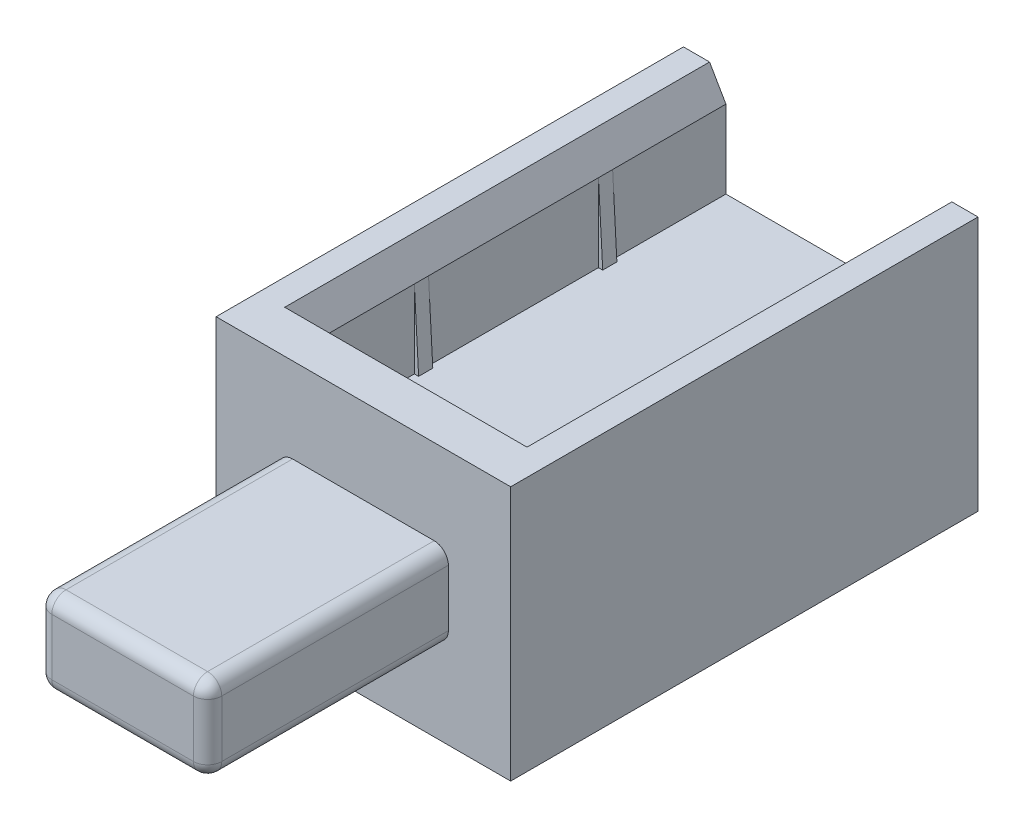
ISO-10303-21;
HEADER;
FILE_DESCRIPTION(('STEP AP214'),'2;1');
FILE_NAME('part.step','',(''),(''),'','','');
FILE_SCHEMA(('AUTOMOTIVE_DESIGN { 1 0 10303 214 1 1 1 1 }'));
ENDSEC;
DATA;
#1=APPLICATION_CONTEXT('core data for automotive mechanical design processes');
#2=APPLICATION_PROTOCOL_DEFINITION('international standard','automotive_design',2000,#1);
#3=PRODUCT_CONTEXT('',#1,'mechanical');
#4=PRODUCT('Part','Part','',(#3));
#5=PRODUCT_RELATED_PRODUCT_CATEGORY('part','',(#4));
#6=PRODUCT_DEFINITION_FORMATION('','',#4);
#7=PRODUCT_DEFINITION_CONTEXT('part definition',#1,'design');
#8=PRODUCT_DEFINITION('design','',#6,#7);
#9=PRODUCT_DEFINITION_SHAPE('','',#8);
#10=(LENGTH_UNIT() NAMED_UNIT(*) SI_UNIT(.MILLI.,.METRE.));
#11=(NAMED_UNIT(*) PLANE_ANGLE_UNIT() SI_UNIT($,.RADIAN.));
#12=(NAMED_UNIT(*) SI_UNIT($,.STERADIAN.) SOLID_ANGLE_UNIT());
#13=UNCERTAINTY_MEASURE_WITH_UNIT(LENGTH_MEASURE(1.E-05),#10,'distance_accuracy_value','');
#14=(GEOMETRIC_REPRESENTATION_CONTEXT(3) GLOBAL_UNCERTAINTY_ASSIGNED_CONTEXT((#13)) GLOBAL_UNIT_ASSIGNED_CONTEXT((#10,
#11,#12)) REPRESENTATION_CONTEXT('',''));
#15=CARTESIAN_POINT('',(0.,0.,0.));
#16=DIRECTION('',(0.,0.,1.));
#17=DIRECTION('',(1.,0.,0.));
#18=AXIS2_PLACEMENT_3D('',#15,#16,#17);
#19=CARTESIAN_POINT('',(-7.4,-1.5,0.));
#20=DIRECTION('',(0.,-1.,0.));
#21=DIRECTION('',(0.,0.,-1.));
#22=AXIS2_PLACEMENT_3D('',#19,#20,#21);
#23=PLANE('',#22);
#24=DIRECTION('',(0.,0.,-1.));
#25=VECTOR('',#24,1.);
#26=CARTESIAN_POINT('',(7.1,-1.5,-8.));
#27=LINE('',#26,#25);
#28=CARTESIAN_POINT('',(7.1,-1.5,-8.));
#29=VERTEX_POINT('',#28);
#30=CARTESIAN_POINT('',(7.1,-1.5,-9.));
#31=VERTEX_POINT('',#30);
#32=EDGE_CURVE('E403',#29,#31,#27,.T.);
#33=ORIENTED_EDGE('',*,*,#32,.F.);
#34=DIRECTION('',(-1.,0.,0.));
#35=VECTOR('',#34,1.);
#36=CARTESIAN_POINT('',(7.1,-1.5,-8.));
#37=LINE('',#36,#35);
#38=CARTESIAN_POINT('',(7.4,-1.5,-8.));
#39=VERTEX_POINT('',#38);
#40=EDGE_CURVE('E406',#39,#29,#37,.T.);
#41=ORIENTED_EDGE('',*,*,#40,.F.);
#42=DIRECTION('',(0.,0.,-1.));
#43=VECTOR('',#42,1.);
#44=CARTESIAN_POINT('',(7.4,-1.5,0.));
#45=LINE('',#44,#43);
#46=CARTESIAN_POINT('',(7.4,-1.5,0.));
#47=VERTEX_POINT('',#46);
#48=EDGE_CURVE('E614',#47,#39,#45,.T.);
#49=ORIENTED_EDGE('',*,*,#48,.F.);
#50=DIRECTION('',(1.,0.,0.));
#51=VECTOR('',#50,1.);
#52=CARTESIAN_POINT('',(-7.4,-1.5,0.));
#53=LINE('',#52,#51);
#54=CARTESIAN_POINT('',(-7.4,-1.5,0.));
#55=VERTEX_POINT('',#54);
#56=EDGE_CURVE('E633',#55,#47,#53,.T.);
#57=ORIENTED_EDGE('',*,*,#56,.F.);
#58=DIRECTION('',(0.,0.,-1.));
#59=VECTOR('',#58,1.);
#60=CARTESIAN_POINT('',(-7.4,-1.5,0.));
#61=LINE('',#60,#59);
#62=CARTESIAN_POINT('',(-7.4,-1.5,-8.));
#63=VERTEX_POINT('',#62);
#64=EDGE_CURVE('E624',#55,#63,#61,.T.);
#65=ORIENTED_EDGE('',*,*,#64,.T.);
#66=DIRECTION('',(-1.,0.,0.));
#67=VECTOR('',#66,1.);
#68=CARTESIAN_POINT('',(-7.4,-1.5,-8.));
#69=LINE('',#68,#67);
#70=CARTESIAN_POINT('',(-7.1,-1.5,-8.));
#71=VERTEX_POINT('',#70);
#72=EDGE_CURVE('E440',#71,#63,#69,.T.);
#73=ORIENTED_EDGE('',*,*,#72,.F.);
#74=DIRECTION('',(0.,0.,-1.));
#75=VECTOR('',#74,1.);
#76=CARTESIAN_POINT('',(-7.1,-1.5,-8.));
#77=LINE('',#76,#75);
#78=CARTESIAN_POINT('',(-7.1,-1.5,-9.));
#79=VERTEX_POINT('',#78);
#80=EDGE_CURVE('E415',#71,#79,#77,.T.);
#81=ORIENTED_EDGE('',*,*,#80,.T.);
#82=DIRECTION('',(-1.,0.,0.));
#83=VECTOR('',#82,1.);
#84=CARTESIAN_POINT('',(-7.4,-1.5,-9.));
#85=LINE('',#84,#83);
#86=CARTESIAN_POINT('',(-7.4,-1.5,-9.));
#87=VERTEX_POINT('',#86);
#88=EDGE_CURVE('E431',#79,#87,#85,.T.);
#89=ORIENTED_EDGE('',*,*,#88,.T.);
#90=CARTESIAN_POINT('',(-7.4,-1.5,-21.));
#91=VERTEX_POINT('',#90);
#92=EDGE_CURVE('E628',#87,#91,#61,.T.);
#93=ORIENTED_EDGE('',*,*,#92,.T.);
#94=DIRECTION('',(1.,0.,0.));
#95=VECTOR('',#94,1.);
#96=CARTESIAN_POINT('',(-7.4,-1.5,-21.));
#97=LINE('',#96,#95);
#98=CARTESIAN_POINT('',(-7.1,-1.5,-21.));
#99=VERTEX_POINT('',#98);
#100=EDGE_CURVE('E520',#91,#99,#97,.T.);
#101=ORIENTED_EDGE('',*,*,#100,.T.);
#102=DIRECTION('',(0.,0.,-1.));
#103=VECTOR('',#102,1.);
#104=CARTESIAN_POINT('',(-7.1,-1.5,-21.));
#105=LINE('',#104,#103);
#106=CARTESIAN_POINT('',(-7.1,-1.5,-22.));
#107=VERTEX_POINT('',#106);
#108=EDGE_CURVE('E511',#99,#107,#105,.T.);
#109=ORIENTED_EDGE('',*,*,#108,.T.);
#110=DIRECTION('',(1.,0.,0.));
#111=VECTOR('',#110,1.);
#112=CARTESIAN_POINT('',(-7.4,-1.5,-22.));
#113=LINE('',#112,#111);
#114=CARTESIAN_POINT('',(-7.4,-1.5,-22.));
#115=VERTEX_POINT('',#114);
#116=EDGE_CURVE('E523',#115,#107,#113,.T.);
#117=ORIENTED_EDGE('',*,*,#116,.F.);
#118=CARTESIAN_POINT('',(-7.4,-1.5,-30.));
#119=VERTEX_POINT('',#118);
#120=EDGE_CURVE('E622',#115,#119,#61,.T.);
#121=ORIENTED_EDGE('',*,*,#120,.T.);
#122=DIRECTION('',(1.,0.,0.));
#123=VECTOR('',#122,1.);
#124=CARTESIAN_POINT('',(-7.4,-1.5,-30.));
#125=LINE('',#124,#123);
#126=CARTESIAN_POINT('',(7.4,-1.5,-30.));
#127=VERTEX_POINT('',#126);
#128=EDGE_CURVE('E629',#119,#127,#125,.T.);
#129=ORIENTED_EDGE('',*,*,#128,.T.);
#130=CARTESIAN_POINT('',(7.4,-1.5,-22.));
#131=VERTEX_POINT('',#130);
#132=EDGE_CURVE('E612',#131,#127,#45,.T.);
#133=ORIENTED_EDGE('',*,*,#132,.F.);
#134=DIRECTION('',(1.,0.,0.));
#135=VECTOR('',#134,1.);
#136=CARTESIAN_POINT('',(7.4,-1.5,-22.));
#137=LINE('',#136,#135);
#138=CARTESIAN_POINT('',(7.1,-1.5,-22.));
#139=VERTEX_POINT('',#138);
#140=EDGE_CURVE('E493',#139,#131,#137,.T.);
#141=ORIENTED_EDGE('',*,*,#140,.F.);
#142=DIRECTION('',(0.,0.,-1.));
#143=VECTOR('',#142,1.);
#144=CARTESIAN_POINT('',(7.1,-1.5,-21.));
#145=LINE('',#144,#143);
#146=CARTESIAN_POINT('',(7.1,-1.5,-21.));
#147=VERTEX_POINT('',#146);
#148=EDGE_CURVE('E487',#147,#139,#145,.T.);
#149=ORIENTED_EDGE('',*,*,#148,.F.);
#150=DIRECTION('',(1.,0.,0.));
#151=VECTOR('',#150,1.);
#152=CARTESIAN_POINT('',(7.4,-1.5,-21.));
#153=LINE('',#152,#151);
#154=CARTESIAN_POINT('',(7.4,-1.5,-21.));
#155=VERTEX_POINT('',#154);
#156=EDGE_CURVE('E490',#147,#155,#153,.T.);
#157=ORIENTED_EDGE('',*,*,#156,.T.);
#158=CARTESIAN_POINT('',(7.4,-1.5,-9.));
#159=VERTEX_POINT('',#158);
#160=EDGE_CURVE('E618',#159,#155,#45,.T.);
#161=ORIENTED_EDGE('',*,*,#160,.F.);
#162=DIRECTION('',(-1.,0.,0.));
#163=VECTOR('',#162,1.);
#164=CARTESIAN_POINT('',(7.1,-1.5,-9.));
#165=LINE('',#164,#163);
#166=EDGE_CURVE('E407',#159,#31,#165,.T.);
#167=ORIENTED_EDGE('',*,*,#166,.T.);
#168=EDGE_LOOP('',(#33,#41,#49,#57,#65,#73,#81,#89,#93,#101,#109,#117,#121,#129,#133,#141,#149,
#157,#161,#167));
#169=FACE_BOUND('',#168,.T.);
#170=ADVANCED_FACE('F43',(#169),#23,.T.);
#171=CARTESIAN_POINT('',(7.4,0.,0.));
#172=DIRECTION('',(1.,0.,0.));
#173=DIRECTION('',(0.,0.,-1.));
#174=AXIS2_PLACEMENT_3D('',#171,#172,#173);
#175=PLANE('',#174);
#176=DIRECTION('',(0.,1.,0.));
#177=VECTOR('',#176,1.);
#178=CARTESIAN_POINT('',(7.4,-1.5,-8.));
#179=LINE('',#178,#177);
#180=CARTESIAN_POINT('',(7.4,-6.99999999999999,-8.));
#181=VERTEX_POINT('',#180);
#182=EDGE_CURVE('E418',#181,#39,#179,.T.);
#183=ORIENTED_EDGE('',*,*,#182,.F.);
#184=DIRECTION('',(0.,0.,1.));
#185=VECTOR('',#184,1.);
#186=CARTESIAN_POINT('',(7.4,-6.99999999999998,0.));
#187=LINE('',#186,#185);
#188=CARTESIAN_POINT('',(7.4,-6.99999999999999,0.));
#189=VERTEX_POINT('',#188);
#190=EDGE_CURVE('E650',#181,#189,#187,.T.);
#191=ORIENTED_EDGE('',*,*,#190,.T.);
#192=DIRECTION('',(0.,-1.,0.));
#193=VECTOR('',#192,1.);
#194=CARTESIAN_POINT('',(7.4,9.,0.));
#195=LINE('',#194,#193);
#196=EDGE_CURVE('E574',#47,#189,#195,.T.);
#197=ORIENTED_EDGE('',*,*,#196,.F.);
#198=ORIENTED_EDGE('',*,*,#48,.T.);
#199=EDGE_LOOP('',(#183,#191,#197,#198));
#200=FACE_BOUND('',#199,.T.);
#201=ADVANCED_FACE('F837',(#200),#175,.F.);
#202=CARTESIAN_POINT('',(-7.4,0.,0.));
#203=DIRECTION('',(-1.,0.,0.));
#204=DIRECTION('',(0.,0.,1.));
#205=AXIS2_PLACEMENT_3D('',#202,#203,#204);
#206=PLANE('',#205);
#207=DIRECTION('',(0.,-1.,0.));
#208=VECTOR('',#207,1.);
#209=CARTESIAN_POINT('',(-7.4,-6.99999999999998,-9.));
#210=LINE('',#209,#208);
#211=CARTESIAN_POINT('',(-7.4,-6.99999999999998,-9.));
#212=VERTEX_POINT('',#211);
#213=EDGE_CURVE('E428',#87,#212,#210,.T.);
#214=ORIENTED_EDGE('',*,*,#213,.T.);
#215=DIRECTION('',(0.,0.,-1.));
#216=VECTOR('',#215,1.);
#217=CARTESIAN_POINT('',(-7.4,-6.99999999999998,0.));
#218=LINE('',#217,#216);
#219=CARTESIAN_POINT('',(-7.4,-6.99999999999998,-21.));
#220=VERTEX_POINT('',#219);
#221=EDGE_CURVE('E683',#212,#220,#218,.T.);
#222=ORIENTED_EDGE('',*,*,#221,.T.);
#223=DIRECTION('',(0.,1.,0.));
#224=VECTOR('',#223,1.);
#225=CARTESIAN_POINT('',(-7.4,-6.99999999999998,-21.));
#226=LINE('',#225,#224);
#227=EDGE_CURVE('E513',#220,#91,#226,.T.);
#228=ORIENTED_EDGE('',*,*,#227,.T.);
#229=ORIENTED_EDGE('',*,*,#92,.F.);
#230=EDGE_LOOP('',(#214,#222,#228,#229));
#231=FACE_BOUND('',#230,.T.);
#232=ADVANCED_FACE('F844',(#231),#206,.F.);
#233=CARTESIAN_POINT('',(-7.4,1.5,0.));
#234=DIRECTION('',(0.,1.,0.));
#235=DIRECTION('',(0.,0.,1.));
#236=AXIS2_PLACEMENT_3D('',#233,#234,#235);
#237=PLANE('',#236);
#238=DIRECTION('',(0.,0.,1.));
#239=VECTOR('',#238,1.);
#240=CARTESIAN_POINT('',(7.4,1.5,0.));
#241=LINE('',#240,#239);
#242=CARTESIAN_POINT('',(7.4,1.5,-8.));
#243=VERTEX_POINT('',#242);
#244=CARTESIAN_POINT('',(7.4,1.5,0.));
#245=VERTEX_POINT('',#244);
#246=EDGE_CURVE('E608',#243,#245,#241,.T.);
#247=ORIENTED_EDGE('',*,*,#246,.F.);
#248=DIRECTION('',(1.,0.,0.));
#249=VECTOR('',#248,1.);
#250=CARTESIAN_POINT('',(7.1,1.5,-8.));
#251=LINE('',#250,#249);
#252=CARTESIAN_POINT('',(7.1,1.5,-8.));
#253=VERTEX_POINT('',#252);
#254=EDGE_CURVE('E449',#253,#243,#251,.T.);
#255=ORIENTED_EDGE('',*,*,#254,.F.);
#256=DIRECTION('',(0.,0.,-1.));
#257=VECTOR('',#256,1.);
#258=CARTESIAN_POINT('',(7.1,1.5,-8.));
#259=LINE('',#258,#257);
#260=CARTESIAN_POINT('',(7.1,1.5,-9.));
#261=VERTEX_POINT('',#260);
#262=EDGE_CURVE('E447',#253,#261,#259,.T.);
#263=ORIENTED_EDGE('',*,*,#262,.T.);
#264=DIRECTION('',(1.,0.,0.));
#265=VECTOR('',#264,1.);
#266=CARTESIAN_POINT('',(7.1,1.5,-9.));
#267=LINE('',#266,#265);
#268=CARTESIAN_POINT('',(7.4,1.5,-9.));
#269=VERTEX_POINT('',#268);
#270=EDGE_CURVE('E450',#261,#269,#267,.T.);
#271=ORIENTED_EDGE('',*,*,#270,.T.);
#272=CARTESIAN_POINT('',(7.4,1.5,-21.));
#273=VERTEX_POINT('',#272);
#274=EDGE_CURVE('E613',#273,#269,#241,.T.);
#275=ORIENTED_EDGE('',*,*,#274,.F.);
#276=DIRECTION('',(-1.,0.,0.));
#277=VECTOR('',#276,1.);
#278=CARTESIAN_POINT('',(7.4,1.5,-21.));
#279=LINE('',#278,#277);
#280=CARTESIAN_POINT('',(7.1,1.5,-21.));
#281=VERTEX_POINT('',#280);
#282=EDGE_CURVE('E542',#273,#281,#279,.T.);
#283=ORIENTED_EDGE('',*,*,#282,.T.);
#284=DIRECTION('',(0.,0.,-1.));
#285=VECTOR('',#284,1.);
#286=CARTESIAN_POINT('',(7.1,1.5,-21.));
#287=LINE('',#286,#285);
#288=CARTESIAN_POINT('',(7.1,1.5,-22.));
#289=VERTEX_POINT('',#288);
#290=EDGE_CURVE('E533',#281,#289,#287,.T.);
#291=ORIENTED_EDGE('',*,*,#290,.T.);
#292=DIRECTION('',(-1.,0.,0.));
#293=VECTOR('',#292,1.);
#294=CARTESIAN_POINT('',(7.4,1.5,-22.));
#295=LINE('',#294,#293);
#296=CARTESIAN_POINT('',(7.4,1.5,-22.));
#297=VERTEX_POINT('',#296);
#298=EDGE_CURVE('E545',#297,#289,#295,.T.);
#299=ORIENTED_EDGE('',*,*,#298,.F.);
#300=CARTESIAN_POINT('',(7.4,1.5,-30.));
#301=VERTEX_POINT('',#300);
#302=EDGE_CURVE('E609',#301,#297,#241,.T.);
#303=ORIENTED_EDGE('',*,*,#302,.F.);
#304=DIRECTION('',(1.,0.,0.));
#305=VECTOR('',#304,1.);
#306=CARTESIAN_POINT('',(-7.4,1.5,-30.));
#307=LINE('',#306,#305);
#308=CARTESIAN_POINT('',(-7.4,1.5,-30.));
#309=VERTEX_POINT('',#308);
#310=EDGE_CURVE('E627',#309,#301,#307,.T.);
#311=ORIENTED_EDGE('',*,*,#310,.F.);
#312=DIRECTION('',(0.,0.,1.));
#313=VECTOR('',#312,1.);
#314=CARTESIAN_POINT('',(-7.4,1.5,0.));
#315=LINE('',#314,#313);
#316=CARTESIAN_POINT('',(-7.4,1.5,-22.));
#317=VERTEX_POINT('',#316);
#318=EDGE_CURVE('E619',#309,#317,#315,.T.);
#319=ORIENTED_EDGE('',*,*,#318,.T.);
#320=DIRECTION('',(-1.,0.,0.));
#321=VECTOR('',#320,1.);
#322=CARTESIAN_POINT('',(-7.4,1.5,-22.));
#323=LINE('',#322,#321);
#324=CARTESIAN_POINT('',(-7.1,1.5,-22.));
#325=VERTEX_POINT('',#324);
#326=EDGE_CURVE('E558',#325,#317,#323,.T.);
#327=ORIENTED_EDGE('',*,*,#326,.F.);
#328=DIRECTION('',(0.,0.,-1.));
#329=VECTOR('',#328,1.);
#330=CARTESIAN_POINT('',(-7.1,1.5,-21.));
#331=LINE('',#330,#329);
#332=CARTESIAN_POINT('',(-7.1,1.5,-21.));
#333=VERTEX_POINT('',#332);
#334=EDGE_CURVE('E571',#333,#325,#331,.T.);
#335=ORIENTED_EDGE('',*,*,#334,.F.);
#336=DIRECTION('',(-1.,0.,0.));
#337=VECTOR('',#336,1.);
#338=CARTESIAN_POINT('',(-7.4,1.5,-21.));
#339=LINE('',#338,#337);
#340=CARTESIAN_POINT('',(-7.4,1.5,-21.));
#341=VERTEX_POINT('',#340);
#342=EDGE_CURVE('E561',#333,#341,#339,.T.);
#343=ORIENTED_EDGE('',*,*,#342,.T.);
#344=CARTESIAN_POINT('',(-7.4,1.5,-9.));
#345=VERTEX_POINT('',#344);
#346=EDGE_CURVE('E623',#341,#345,#315,.T.);
#347=ORIENTED_EDGE('',*,*,#346,.T.);
#348=DIRECTION('',(1.,0.,0.));
#349=VECTOR('',#348,1.);
#350=CARTESIAN_POINT('',(-7.4,1.5,-9.));
#351=LINE('',#350,#349);
#352=CARTESIAN_POINT('',(-7.1,1.5,-9.));
#353=VERTEX_POINT('',#352);
#354=EDGE_CURVE('E459',#345,#353,#351,.T.);
#355=ORIENTED_EDGE('',*,*,#354,.T.);
#356=DIRECTION('',(0.,0.,-1.));
#357=VECTOR('',#356,1.);
#358=CARTESIAN_POINT('',(-7.1,1.5,-8.));
#359=LINE('',#358,#357);
#360=CARTESIAN_POINT('',(-7.1,1.5,-8.));
#361=VERTEX_POINT('',#360);
#362=EDGE_CURVE('E484',#361,#353,#359,.T.);
#363=ORIENTED_EDGE('',*,*,#362,.F.);
#364=DIRECTION('',(1.,0.,0.));
#365=VECTOR('',#364,1.);
#366=CARTESIAN_POINT('',(-7.4,1.5,-8.));
#367=LINE('',#366,#365);
#368=CARTESIAN_POINT('',(-7.4,1.5,-8.));
#369=VERTEX_POINT('',#368);
#370=EDGE_CURVE('E467',#369,#361,#367,.T.);
#371=ORIENTED_EDGE('',*,*,#370,.F.);
#372=CARTESIAN_POINT('',(-7.4,1.5,0.));
#373=VERTEX_POINT('',#372);
#374=EDGE_CURVE('E617',#369,#373,#315,.T.);
#375=ORIENTED_EDGE('',*,*,#374,.T.);
#376=DIRECTION('',(1.,0.,0.));
#377=VECTOR('',#376,1.);
#378=CARTESIAN_POINT('',(-7.4,1.5,0.));
#379=LINE('',#378,#377);
#380=EDGE_CURVE('E636',#373,#245,#379,.T.);
#381=ORIENTED_EDGE('',*,*,#380,.T.);
#382=EDGE_LOOP('',(#247,#255,#263,#271,#275,#283,#291,#299,#303,#311,#319,#327,#335,#343,#347,
#355,#363,#371,#375,#381));
#383=FACE_BOUND('',#382,.T.);
#384=ADVANCED_FACE('F852',(#383),#237,.T.);
#385=DIRECTION('',(0.,1.,0.));
#386=VECTOR('',#385,1.);
#387=CARTESIAN_POINT('',(7.4,1.5,-8.));
#388=LINE('',#387,#386);
#389=CARTESIAN_POINT('',(7.4,6.99999999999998,-8.));
#390=VERTEX_POINT('',#389);
#391=EDGE_CURVE('E453',#243,#390,#388,.T.);
#392=ORIENTED_EDGE('',*,*,#391,.F.);
#393=ORIENTED_EDGE('',*,*,#246,.T.);
#394=CARTESIAN_POINT('',(7.4,6.99999999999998,0.));
#395=VERTEX_POINT('',#394);
#396=EDGE_CURVE('E583',#395,#245,#195,.T.);
#397=ORIENTED_EDGE('',*,*,#396,.F.);
#398=DIRECTION('',(0.,0.,-1.));
#399=VECTOR('',#398,1.);
#400=CARTESIAN_POINT('',(7.4,6.99999999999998,0.));
#401=LINE('',#400,#399);
#402=EDGE_CURVE('E671',#395,#390,#401,.T.);
#403=ORIENTED_EDGE('',*,*,#402,.T.);
#404=EDGE_LOOP('',(#392,#393,#397,#403));
#405=FACE_BOUND('',#404,.T.);
#406=ADVANCED_FACE('F847',(#405),#175,.F.);
#407=DIRECTION('',(0.,-1.,0.));
#408=VECTOR('',#407,1.);
#409=CARTESIAN_POINT('',(-7.4,6.99999999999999,-8.));
#410=LINE('',#409,#408);
#411=CARTESIAN_POINT('',(-7.4,6.99999999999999,-8.));
#412=VERTEX_POINT('',#411);
#413=EDGE_CURVE('E474',#412,#369,#410,.T.);
#414=ORIENTED_EDGE('',*,*,#413,.F.);
#415=DIRECTION('',(0.,0.,1.));
#416=VECTOR('',#415,1.);
#417=CARTESIAN_POINT('',(-7.4,6.99999999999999,0.));
#418=LINE('',#417,#416);
#419=CARTESIAN_POINT('',(-7.4,6.99999999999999,0.));
#420=VERTEX_POINT('',#419);
#421=EDGE_CURVE('E686',#412,#420,#418,.T.);
#422=ORIENTED_EDGE('',*,*,#421,.T.);
#423=DIRECTION('',(0.,1.,0.));
#424=VECTOR('',#423,1.);
#425=CARTESIAN_POINT('',(-7.4,-9.,0.));
#426=LINE('',#425,#424);
#427=EDGE_CURVE('E601',#373,#420,#426,.T.);
#428=ORIENTED_EDGE('',*,*,#427,.F.);
#429=ORIENTED_EDGE('',*,*,#374,.F.);
#430=EDGE_LOOP('',(#414,#422,#428,#429));
#431=FACE_BOUND('',#430,.T.);
#432=ADVANCED_FACE('F1066',(#431),#206,.F.);
#433=DIRECTION('',(0.,-1.,0.));
#434=VECTOR('',#433,1.);
#435=CARTESIAN_POINT('',(7.4,-6.99999999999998,-22.));
#436=LINE('',#435,#434);
#437=CARTESIAN_POINT('',(7.4,-6.99999999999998,-22.));
#438=VERTEX_POINT('',#437);
#439=EDGE_CURVE('E500',#131,#438,#436,.T.);
#440=ORIENTED_EDGE('',*,*,#439,.F.);
#441=ORIENTED_EDGE('',*,*,#132,.T.);
#442=DIRECTION('',(0.,1.,0.));
#443=VECTOR('',#442,1.);
#444=CARTESIAN_POINT('',(7.4,9.,-30.));
#445=LINE('',#444,#443);
#446=CARTESIAN_POINT('',(7.4,-6.99999999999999,-30.));
#447=VERTEX_POINT('',#446);
#448=EDGE_CURVE('E578',#447,#127,#445,.T.);
#449=ORIENTED_EDGE('',*,*,#448,.F.);
#450=EDGE_CURVE('E651',#447,#438,#187,.T.);
#451=ORIENTED_EDGE('',*,*,#450,.T.);
#452=EDGE_LOOP('',(#440,#441,#449,#451));
#453=FACE_BOUND('',#452,.T.);
#454=ADVANCED_FACE('F1070',(#453),#175,.F.);
#455=DIRECTION('',(0.,1.,0.));
#456=VECTOR('',#455,1.);
#457=CARTESIAN_POINT('',(-7.4,-6.99999999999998,-22.));
#458=LINE('',#457,#456);
#459=CARTESIAN_POINT('',(-7.4,-6.99999999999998,-22.));
#460=VERTEX_POINT('',#459);
#461=EDGE_CURVE('E516',#460,#115,#458,.T.);
#462=ORIENTED_EDGE('',*,*,#461,.F.);
#463=CARTESIAN_POINT('',(-7.4,-6.99999999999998,-30.));
#464=VERTEX_POINT('',#463);
#465=EDGE_CURVE('E678',#460,#464,#218,.T.);
#466=ORIENTED_EDGE('',*,*,#465,.T.);
#467=DIRECTION('',(0.,-1.,0.));
#468=VECTOR('',#467,1.);
#469=CARTESIAN_POINT('',(-7.4,-9.,-30.));
#470=LINE('',#469,#468);
#471=EDGE_CURVE('E594',#119,#464,#470,.T.);
#472=ORIENTED_EDGE('',*,*,#471,.F.);
#473=ORIENTED_EDGE('',*,*,#120,.F.);
#474=EDGE_LOOP('',(#462,#466,#472,#473));
#475=FACE_BOUND('',#474,.T.);
#476=ADVANCED_FACE('F1072',(#475),#206,.F.);
#477=DIRECTION('',(0.,-1.,0.));
#478=VECTOR('',#477,1.);
#479=CARTESIAN_POINT('',(7.4,6.99999999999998,-22.));
#480=LINE('',#479,#478);
#481=CARTESIAN_POINT('',(7.4,6.99999999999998,-22.));
#482=VERTEX_POINT('',#481);
#483=EDGE_CURVE('E538',#482,#297,#480,.T.);
#484=ORIENTED_EDGE('',*,*,#483,.F.);
#485=CARTESIAN_POINT('',(7.4,6.99999999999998,-30.));
#486=VERTEX_POINT('',#485);
#487=EDGE_CURVE('E670',#482,#486,#401,.T.);
#488=ORIENTED_EDGE('',*,*,#487,.T.);
#489=EDGE_CURVE('E586',#301,#486,#445,.T.);
#490=ORIENTED_EDGE('',*,*,#489,.F.);
#491=ORIENTED_EDGE('',*,*,#302,.T.);
#492=EDGE_LOOP('',(#484,#488,#490,#491));
#493=FACE_BOUND('',#492,.T.);
#494=ADVANCED_FACE('F1133',(#493),#175,.F.);
#495=DIRECTION('',(0.,1.,0.));
#496=VECTOR('',#495,1.);
#497=CARTESIAN_POINT('',(-7.4,6.99999999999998,-22.));
#498=LINE('',#497,#496);
#499=CARTESIAN_POINT('',(-7.4,6.99999999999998,-22.));
#500=VERTEX_POINT('',#499);
#501=EDGE_CURVE('E548',#317,#500,#498,.T.);
#502=ORIENTED_EDGE('',*,*,#501,.F.);
#503=ORIENTED_EDGE('',*,*,#318,.F.);
#504=CARTESIAN_POINT('',(-7.4,6.99999999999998,-30.));
#505=VERTEX_POINT('',#504);
#506=EDGE_CURVE('E599',#505,#309,#470,.T.);
#507=ORIENTED_EDGE('',*,*,#506,.F.);
#508=EDGE_CURVE('E687',#505,#500,#418,.T.);
#509=ORIENTED_EDGE('',*,*,#508,.T.);
#510=EDGE_LOOP('',(#502,#503,#507,#509));
#511=FACE_BOUND('',#510,.T.);
#512=ADVANCED_FACE('F860',(#511),#206,.F.);
#513=CARTESIAN_POINT('',(-7.4,-1.5,-30.));
#514=DIRECTION('',(0.,0.,-1.));
#515=DIRECTION('',(-1.,0.,0.));
#516=AXIS2_PLACEMENT_3D('',#513,#514,#515);
#517=PLANE('',#516);
#518=DIRECTION('',(-1.,0.,0.));
#519=VECTOR('',#518,1.);
#520=CARTESIAN_POINT('',(10.4,-9.,-30.));
#521=LINE('',#520,#519);
#522=CARTESIAN_POINT('',(10.4,-9.,-30.));
#523=VERTEX_POINT('',#522);
#524=CARTESIAN_POINT('',(8.55470053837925,-9.,-30.));
#525=VERTEX_POINT('',#524);
#526=EDGE_CURVE('E591',#523,#525,#521,.T.);
#527=ORIENTED_EDGE('',*,*,#526,.T.);
#528=DIRECTION('',(0.499999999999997,-0.86602540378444,0.));
#529=VECTOR('',#528,1.);
#530=CARTESIAN_POINT('',(1.31843013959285,3.53358798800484,-30.));
#531=LINE('',#530,#529);
#532=EDGE_CURVE('E648',#525,#447,#531,.F.);
#533=ORIENTED_EDGE('',*,*,#532,.T.);
#534=ORIENTED_EDGE('',*,*,#448,.T.);
#535=ORIENTED_EDGE('',*,*,#128,.F.);
#536=ORIENTED_EDGE('',*,*,#471,.T.);
#537=DIRECTION('',(0.499999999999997,0.86602540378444,0.));
#538=VECTOR('',#537,1.);
#539=CARTESIAN_POINT('',(-5.01843013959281,-2.87499999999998,-30.));
#540=LINE('',#539,#538);
#541=CARTESIAN_POINT('',(-8.55470053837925,-9.,-30.));
#542=VERTEX_POINT('',#541);
#543=EDGE_CURVE('E644',#464,#542,#540,.F.);
#544=ORIENTED_EDGE('',*,*,#543,.T.);
#545=DIRECTION('',(1.,0.,0.));
#546=VECTOR('',#545,1.);
#547=CARTESIAN_POINT('',(-10.4,-9.,-30.));
#548=LINE('',#547,#546);
#549=CARTESIAN_POINT('',(-10.4,-9.,-30.));
#550=VERTEX_POINT('',#549);
#551=EDGE_CURVE('E606',#550,#542,#548,.T.);
#552=ORIENTED_EDGE('',*,*,#551,.F.);
#553=DIRECTION('',(0.,-1.,0.));
#554=VECTOR('',#553,1.);
#555=CARTESIAN_POINT('',(-10.4,-9.,-30.));
#556=LINE('',#555,#554);
#557=CARTESIAN_POINT('',(-10.4,9.,-30.));
#558=VERTEX_POINT('',#557);
#559=EDGE_CURVE('E368',#558,#550,#556,.T.);
#560=ORIENTED_EDGE('',*,*,#559,.F.);
#561=DIRECTION('',(1.,0.,0.));
#562=VECTOR('',#561,1.);
#563=CARTESIAN_POINT('',(-10.4,9.,-30.));
#564=LINE('',#563,#562);
#565=CARTESIAN_POINT('',(-8.55470053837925,9.,-30.));
#566=VERTEX_POINT('',#565);
#567=EDGE_CURVE('E598',#558,#566,#564,.T.);
#568=ORIENTED_EDGE('',*,*,#567,.T.);
#569=DIRECTION('',(-0.499999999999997,0.86602540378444,0.));
#570=VECTOR('',#569,1.);
#571=CARTESIAN_POINT('',(-3.71939203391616,0.624999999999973,-30.));
#572=LINE('',#571,#570);
#573=EDGE_CURVE('E642',#566,#505,#572,.F.);
#574=ORIENTED_EDGE('',*,*,#573,.T.);
#575=ORIENTED_EDGE('',*,*,#506,.T.);
#576=ORIENTED_EDGE('',*,*,#310,.T.);
#577=ORIENTED_EDGE('',*,*,#489,.T.);
#578=DIRECTION('',(-0.499999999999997,-0.86602540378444,0.));
#579=VECTOR('',#578,1.);
#580=CARTESIAN_POINT('',(0.0193920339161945,-5.78358798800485,-30.));
#581=LINE('',#580,#579);
#582=CARTESIAN_POINT('',(8.55470053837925,9.,-30.));
#583=VERTEX_POINT('',#582);
#584=EDGE_CURVE('E646',#486,#583,#581,.F.);
#585=ORIENTED_EDGE('',*,*,#584,.T.);
#586=DIRECTION('',(-1.,0.,0.));
#587=VECTOR('',#586,1.);
#588=CARTESIAN_POINT('',(10.4,9.,-30.));
#589=LINE('',#588,#587);
#590=CARTESIAN_POINT('',(10.4,9.,-30.));
#591=VERTEX_POINT('',#590);
#592=EDGE_CURVE('E582',#591,#583,#589,.T.);
#593=ORIENTED_EDGE('',*,*,#592,.F.);
#594=DIRECTION('',(0.,1.,0.));
#595=VECTOR('',#594,1.);
#596=CARTESIAN_POINT('',(10.4,9.,-30.));
#597=LINE('',#596,#595);
#598=EDGE_CURVE('E577',#523,#591,#597,.T.);
#599=ORIENTED_EDGE('',*,*,#598,.F.);
#600=EDGE_LOOP('',(#527,#533,#534,#535,#536,#544,#552,#560,#568,#574,#575,#576,#577,#585,#593,#599));
#601=FACE_BOUND('',#600,.T.);
#602=ADVANCED_FACE('F856',(#601),#517,.T.);
#603=CARTESIAN_POINT('',(-7.4,-6.99999999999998,0.));
#604=VERTEX_POINT('',#603);
#605=CARTESIAN_POINT('',(-7.4,-6.99999999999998,-8.));
#606=VERTEX_POINT('',#605);
#607=EDGE_CURVE('E679',#604,#606,#218,.T.);
#608=ORIENTED_EDGE('',*,*,#607,.T.);
#609=DIRECTION('',(0.,-1.,0.));
#610=VECTOR('',#609,1.);
#611=CARTESIAN_POINT('',(-7.4,-6.99999999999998,-8.));
#612=LINE('',#611,#610);
#613=EDGE_CURVE('E427',#63,#606,#612,.T.);
#614=ORIENTED_EDGE('',*,*,#613,.F.);
#615=ORIENTED_EDGE('',*,*,#64,.F.);
#616=EDGE_CURVE('E595',#604,#55,#426,.T.);
#617=ORIENTED_EDGE('',*,*,#616,.F.);
#618=EDGE_LOOP('',(#608,#614,#615,#617));
#619=FACE_BOUND('',#618,.T.);
#620=ADVANCED_FACE('F859',(#619),#206,.F.);
#621=CARTESIAN_POINT('',(-10.4,-9.,0.));
#622=DIRECTION('',(0.,1.,0.));
#623=DIRECTION('',(0.,0.,1.));
#624=AXIS2_PLACEMENT_3D('',#621,#622,#623);
#625=PLANE('',#624);
#626=ORIENTED_EDGE('',*,*,#551,.T.);
#627=DIRECTION('',(0.,0.,1.));
#628=VECTOR('',#627,1.);
#629=CARTESIAN_POINT('',(-8.55470053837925,-9.,0.));
#630=LINE('',#629,#628);
#631=CARTESIAN_POINT('',(-8.55470053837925,-9.,0.));
#632=VERTEX_POINT('',#631);
#633=EDGE_CURVE('E674',#542,#632,#630,.T.);
#634=ORIENTED_EDGE('',*,*,#633,.T.);
#635=DIRECTION('',(1.,0.,0.));
#636=VECTOR('',#635,1.);
#637=CARTESIAN_POINT('',(-10.4,-9.,0.));
#638=LINE('',#637,#636);
#639=CARTESIAN_POINT('',(8.55470053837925,-9.,0.));
#640=VERTEX_POINT('',#639);
#641=EDGE_CURVE('E391',#632,#640,#638,.T.);
#642=ORIENTED_EDGE('',*,*,#641,.T.);
#643=DIRECTION('',(0.,0.,-1.));
#644=VECTOR('',#643,1.);
#645=CARTESIAN_POINT('',(8.55470053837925,-9.,0.));
#646=LINE('',#645,#644);
#647=EDGE_CURVE('E632',#640,#525,#646,.T.);
#648=ORIENTED_EDGE('',*,*,#647,.T.);
#649=ORIENTED_EDGE('',*,*,#526,.F.);
#650=DIRECTION('',(0.,0.,-1.));
#651=VECTOR('',#650,1.);
#652=CARTESIAN_POINT('',(10.4,-9.,0.));
#653=LINE('',#652,#651);
#654=CARTESIAN_POINT('',(10.4,-9.,3.));
#655=VERTEX_POINT('',#654);
#656=EDGE_CURVE('E378',#655,#523,#653,.T.);
#657=ORIENTED_EDGE('',*,*,#656,.F.);
#658=DIRECTION('',(1.,0.,0.));
#659=VECTOR('',#658,1.);
#660=CARTESIAN_POINT('',(-10.4,-9.,3.));
#661=LINE('',#660,#659);
#662=CARTESIAN_POINT('',(-10.4,-9.,3.));
#663=VERTEX_POINT('',#662);
#664=EDGE_CURVE('E375',#663,#655,#661,.T.);
#665=ORIENTED_EDGE('',*,*,#664,.F.);
#666=DIRECTION('',(0.,0.,1.));
#667=VECTOR('',#666,1.);
#668=CARTESIAN_POINT('',(-10.4,-9.,0.));
#669=LINE('',#668,#667);
#670=EDGE_CURVE('E362',#550,#663,#669,.T.);
#671=ORIENTED_EDGE('',*,*,#670,.F.);
#672=EDGE_LOOP('',(#626,#634,#642,#648,#649,#657,#665,#671));
#673=FACE_BOUND('',#672,.T.);
#674=ADVANCED_FACE('F376',(#673),#625,.F.);
#675=CARTESIAN_POINT('',(-10.4,9.,0.));
#676=DIRECTION('',(0.,-1.,0.));
#677=DIRECTION('',(0.,0.,-1.));
#678=AXIS2_PLACEMENT_3D('',#675,#676,#677);
#679=PLANE('',#678);
#680=DIRECTION('',(0.,0.,-1.));
#681=VECTOR('',#680,1.);
#682=CARTESIAN_POINT('',(-10.4,9.,0.));
#683=LINE('',#682,#681);
#684=CARTESIAN_POINT('',(-10.4,9.,3.));
#685=VERTEX_POINT('',#684);
#686=EDGE_CURVE('E372',#685,#558,#683,.T.);
#687=ORIENTED_EDGE('',*,*,#686,.F.);
#688=DIRECTION('',(-1.,0.,0.));
#689=VECTOR('',#688,1.);
#690=CARTESIAN_POINT('',(-10.4,9.,3.));
#691=LINE('',#690,#689);
#692=CARTESIAN_POINT('',(10.4,9.,3.));
#693=VERTEX_POINT('',#692);
#694=EDGE_CURVE('E387',#693,#685,#691,.T.);
#695=ORIENTED_EDGE('',*,*,#694,.F.);
#696=DIRECTION('',(0.,0.,1.));
#697=VECTOR('',#696,1.);
#698=CARTESIAN_POINT('',(10.4,9.,0.));
#699=LINE('',#698,#697);
#700=EDGE_CURVE('E580',#591,#693,#699,.T.);
#701=ORIENTED_EDGE('',*,*,#700,.F.);
#702=ORIENTED_EDGE('',*,*,#592,.T.);
#703=DIRECTION('',(0.,0.,1.));
#704=VECTOR('',#703,1.);
#705=CARTESIAN_POINT('',(8.55470053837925,9.,0.));
#706=LINE('',#705,#704);
#707=CARTESIAN_POINT('',(8.55470053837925,9.,0.));
#708=VERTEX_POINT('',#707);
#709=EDGE_CURVE('E667',#583,#708,#706,.T.);
#710=ORIENTED_EDGE('',*,*,#709,.T.);
#711=DIRECTION('',(-1.,0.,0.));
#712=VECTOR('',#711,1.);
#713=CARTESIAN_POINT('',(-10.4,9.,0.));
#714=LINE('',#713,#712);
#715=CARTESIAN_POINT('',(-8.55470053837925,9.,0.));
#716=VERTEX_POINT('',#715);
#717=EDGE_CURVE('E388',#708,#716,#714,.T.);
#718=ORIENTED_EDGE('',*,*,#717,.T.);
#719=DIRECTION('',(0.,0.,-1.));
#720=VECTOR('',#719,1.);
#721=CARTESIAN_POINT('',(-8.55470053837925,9.,0.));
#722=LINE('',#721,#720);
#723=EDGE_CURVE('E682',#716,#566,#722,.T.);
#724=ORIENTED_EDGE('',*,*,#723,.T.);
#725=ORIENTED_EDGE('',*,*,#567,.F.);
#726=EDGE_LOOP('',(#687,#695,#701,#702,#710,#718,#724,#725));
#727=FACE_BOUND('',#726,.T.);
#728=ADVANCED_FACE('F1034',(#727),#679,.F.);
#729=CARTESIAN_POINT('',(-10.4,0.,0.));
#730=DIRECTION('',(-1.,0.,0.));
#731=DIRECTION('',(0.,0.,1.));
#732=AXIS2_PLACEMENT_3D('',#729,#730,#731);
#733=PLANE('',#732);
#734=ORIENTED_EDGE('',*,*,#559,.T.);
#735=ORIENTED_EDGE('',*,*,#670,.T.);
#736=DIRECTION('',(0.,-1.,0.));
#737=VECTOR('',#736,1.);
#738=CARTESIAN_POINT('',(-10.4,9.,3.));
#739=LINE('',#738,#737);
#740=EDGE_CURVE('E366',#685,#663,#739,.T.);
#741=ORIENTED_EDGE('',*,*,#740,.F.);
#742=ORIENTED_EDGE('',*,*,#686,.T.);
#743=EDGE_LOOP('',(#734,#735,#741,#742));
#744=FACE_BOUND('',#743,.T.);
#745=ADVANCED_FACE('F364',(#744),#733,.T.);
#746=CARTESIAN_POINT('',(-7.4,6.99999999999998,-21.));
#747=VERTEX_POINT('',#746);
#748=CARTESIAN_POINT('',(-7.4,6.99999999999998,-9.));
#749=VERTEX_POINT('',#748);
#750=EDGE_CURVE('E691',#747,#749,#418,.T.);
#751=ORIENTED_EDGE('',*,*,#750,.T.);
#752=DIRECTION('',(0.,-1.,0.));
#753=VECTOR('',#752,1.);
#754=CARTESIAN_POINT('',(-7.4,6.99999999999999,-9.));
#755=LINE('',#754,#753);
#756=EDGE_CURVE('E471',#749,#345,#755,.T.);
#757=ORIENTED_EDGE('',*,*,#756,.T.);
#758=ORIENTED_EDGE('',*,*,#346,.F.);
#759=DIRECTION('',(0.,1.,0.));
#760=VECTOR('',#759,1.);
#761=CARTESIAN_POINT('',(-7.4,6.99999999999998,-21.));
#762=LINE('',#761,#760);
#763=EDGE_CURVE('E554',#341,#747,#762,.T.);
#764=ORIENTED_EDGE('',*,*,#763,.T.);
#765=EDGE_LOOP('',(#751,#757,#758,#764));
#766=FACE_BOUND('',#765,.T.);
#767=ADVANCED_FACE('F1033',(#766),#206,.F.);
#768=ORIENTED_EDGE('',*,*,#274,.T.);
#769=DIRECTION('',(0.,1.,0.));
#770=VECTOR('',#769,1.);
#771=CARTESIAN_POINT('',(7.4,1.5,-9.));
#772=LINE('',#771,#770);
#773=CARTESIAN_POINT('',(7.4,6.99999999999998,-9.));
#774=VERTEX_POINT('',#773);
#775=EDGE_CURVE('E456',#269,#774,#772,.T.);
#776=ORIENTED_EDGE('',*,*,#775,.T.);
#777=CARTESIAN_POINT('',(7.4,6.99999999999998,-21.));
#778=VERTEX_POINT('',#777);
#779=EDGE_CURVE('E675',#774,#778,#401,.T.);
#780=ORIENTED_EDGE('',*,*,#779,.T.);
#781=DIRECTION('',(0.,-1.,0.));
#782=VECTOR('',#781,1.);
#783=CARTESIAN_POINT('',(7.4,6.99999999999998,-21.));
#784=LINE('',#783,#782);
#785=EDGE_CURVE('E535',#778,#273,#784,.T.);
#786=ORIENTED_EDGE('',*,*,#785,.T.);
#787=EDGE_LOOP('',(#768,#776,#780,#786));
#788=FACE_BOUND('',#787,.T.);
#789=ADVANCED_FACE('F848',(#788),#175,.F.);
#790=CARTESIAN_POINT('',(7.4,-6.99999999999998,-21.));
#791=VERTEX_POINT('',#790);
#792=CARTESIAN_POINT('',(7.4,-6.99999999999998,-9.));
#793=VERTEX_POINT('',#792);
#794=EDGE_CURVE('E655',#791,#793,#187,.T.);
#795=ORIENTED_EDGE('',*,*,#794,.T.);
#796=DIRECTION('',(0.,1.,0.));
#797=VECTOR('',#796,1.);
#798=CARTESIAN_POINT('',(7.4,-1.5,-9.));
#799=LINE('',#798,#797);
#800=EDGE_CURVE('E409',#793,#159,#799,.T.);
#801=ORIENTED_EDGE('',*,*,#800,.T.);
#802=ORIENTED_EDGE('',*,*,#160,.T.);
#803=DIRECTION('',(0.,-1.,0.));
#804=VECTOR('',#803,1.);
#805=CARTESIAN_POINT('',(7.4,-6.99999999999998,-21.));
#806=LINE('',#805,#804);
#807=EDGE_CURVE('E497',#155,#791,#806,.T.);
#808=ORIENTED_EDGE('',*,*,#807,.T.);
#809=EDGE_LOOP('',(#795,#801,#802,#808));
#810=FACE_BOUND('',#809,.T.);
#811=ADVANCED_FACE('F1022',(#810),#175,.F.);
#812=CARTESIAN_POINT('',(10.4,0.,0.));
#813=DIRECTION('',(1.,0.,0.));
#814=DIRECTION('',(0.,0.,-1.));
#815=AXIS2_PLACEMENT_3D('',#812,#813,#814);
#816=PLANE('',#815);
#817=ORIENTED_EDGE('',*,*,#700,.T.);
#818=DIRECTION('',(0.,1.,0.));
#819=VECTOR('',#818,1.);
#820=CARTESIAN_POINT('',(10.4,9.,3.));
#821=LINE('',#820,#819);
#822=EDGE_CURVE('E382',#655,#693,#821,.T.);
#823=ORIENTED_EDGE('',*,*,#822,.F.);
#824=ORIENTED_EDGE('',*,*,#656,.T.);
#825=ORIENTED_EDGE('',*,*,#598,.T.);
#826=EDGE_LOOP('',(#817,#823,#824,#825));
#827=FACE_BOUND('',#826,.T.);
#828=ADVANCED_FACE('F870',(#827),#816,.T.);
#829=CARTESIAN_POINT('',(8.55470053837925,-9.,0.));
#830=DIRECTION('',(0.86602540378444,0.499999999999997,0.));
#831=DIRECTION('',(0.,0.,-1.));
#832=AXIS2_PLACEMENT_3D('',#829,#830,#831);
#833=PLANE('',#832);
#834=DIRECTION('',(-0.499999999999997,0.86602540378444,0.));
#835=VECTOR('',#834,1.);
#836=CARTESIAN_POINT('',(0.0193920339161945,5.78358798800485,0.));
#837=LINE('',#836,#835);
#838=EDGE_CURVE('E664',#189,#640,#837,.F.);
#839=ORIENTED_EDGE('',*,*,#838,.F.);
#840=ORIENTED_EDGE('',*,*,#190,.F.);
#841=DIRECTION('',(0.,0.,-1.));
#842=VECTOR('',#841,1.);
#843=CARTESIAN_POINT('',(7.4,-6.99999999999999,-8.));
#844=LINE('',#843,#842);
#845=EDGE_CURVE('E399',#181,#793,#844,.T.);
#846=ORIENTED_EDGE('',*,*,#845,.T.);
#847=ORIENTED_EDGE('',*,*,#794,.F.);
#848=DIRECTION('',(0.,0.,-1.));
#849=VECTOR('',#848,1.);
#850=CARTESIAN_POINT('',(7.4,-6.99999999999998,-21.));
#851=LINE('',#850,#849);
#852=EDGE_CURVE('E488',#791,#438,#851,.T.);
#853=ORIENTED_EDGE('',*,*,#852,.T.);
#854=ORIENTED_EDGE('',*,*,#450,.F.);
#855=ORIENTED_EDGE('',*,*,#532,.F.);
#856=ORIENTED_EDGE('',*,*,#647,.F.);
#857=EDGE_LOOP('',(#839,#840,#846,#847,#853,#854,#855,#856));
#858=FACE_BOUND('',#857,.T.);
#859=ADVANCED_FACE('F863',(#858),#833,.F.);
#860=CARTESIAN_POINT('',(8.55470053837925,9.,0.));
#861=DIRECTION('',(0.86602540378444,-0.499999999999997,0.));
#862=DIRECTION('',(0.,0.,1.));
#863=AXIS2_PLACEMENT_3D('',#860,#861,#862);
#864=PLANE('',#863);
#865=ORIENTED_EDGE('',*,*,#584,.F.);
#866=ORIENTED_EDGE('',*,*,#487,.F.);
#867=DIRECTION('',(0.,0.,-1.));
#868=VECTOR('',#867,1.);
#869=CARTESIAN_POINT('',(7.4,6.99999999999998,-21.));
#870=LINE('',#869,#868);
#871=EDGE_CURVE('E526',#778,#482,#870,.T.);
#872=ORIENTED_EDGE('',*,*,#871,.F.);
#873=ORIENTED_EDGE('',*,*,#779,.F.);
#874=DIRECTION('',(0.,0.,-1.));
#875=VECTOR('',#874,1.);
#876=CARTESIAN_POINT('',(7.4,6.99999999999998,-8.));
#877=LINE('',#876,#875);
#878=EDGE_CURVE('E437',#390,#774,#877,.T.);
#879=ORIENTED_EDGE('',*,*,#878,.F.);
#880=ORIENTED_EDGE('',*,*,#402,.F.);
#881=DIRECTION('',(0.499999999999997,0.86602540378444,0.));
#882=VECTOR('',#881,1.);
#883=CARTESIAN_POINT('',(1.31843013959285,-3.53358798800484,0.));
#884=LINE('',#883,#882);
#885=EDGE_CURVE('E661',#708,#395,#884,.F.);
#886=ORIENTED_EDGE('',*,*,#885,.F.);
#887=ORIENTED_EDGE('',*,*,#709,.F.);
#888=EDGE_LOOP('',(#865,#866,#872,#873,#879,#880,#886,#887));
#889=FACE_BOUND('',#888,.T.);
#890=ADVANCED_FACE('F869',(#889),#864,.F.);
#891=CARTESIAN_POINT('',(-8.55470053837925,-9.,0.));
#892=DIRECTION('',(-0.86602540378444,0.499999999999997,0.));
#893=DIRECTION('',(0.,0.,1.));
#894=AXIS2_PLACEMENT_3D('',#891,#892,#893);
#895=PLANE('',#894);
#896=ORIENTED_EDGE('',*,*,#543,.F.);
#897=ORIENTED_EDGE('',*,*,#465,.F.);
#898=DIRECTION('',(0.,0.,-1.));
#899=VECTOR('',#898,1.);
#900=CARTESIAN_POINT('',(-7.4,-6.99999999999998,-21.));
#901=LINE('',#900,#899);
#902=EDGE_CURVE('E503',#220,#460,#901,.T.);
#903=ORIENTED_EDGE('',*,*,#902,.F.);
#904=ORIENTED_EDGE('',*,*,#221,.F.);
#905=DIRECTION('',(0.,0.,-1.));
#906=VECTOR('',#905,1.);
#907=CARTESIAN_POINT('',(-7.4,-6.99999999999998,-8.));
#908=LINE('',#907,#906);
#909=EDGE_CURVE('E424',#606,#212,#908,.T.);
#910=ORIENTED_EDGE('',*,*,#909,.F.);
#911=ORIENTED_EDGE('',*,*,#607,.F.);
#912=DIRECTION('',(-0.499999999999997,-0.86602540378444,0.));
#913=VECTOR('',#912,1.);
#914=CARTESIAN_POINT('',(-3.71939203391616,-0.624999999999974,0.));
#915=LINE('',#914,#913);
#916=EDGE_CURVE('E658',#632,#604,#915,.F.);
#917=ORIENTED_EDGE('',*,*,#916,.F.);
#918=ORIENTED_EDGE('',*,*,#633,.F.);
#919=EDGE_LOOP('',(#896,#897,#903,#904,#910,#911,#917,#918));
#920=FACE_BOUND('',#919,.T.);
#921=ADVANCED_FACE('F877',(#920),#895,.F.);
#922=CARTESIAN_POINT('',(-8.55470053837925,9.,0.));
#923=DIRECTION('',(-0.86602540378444,-0.499999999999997,0.));
#924=DIRECTION('',(0.,0.,-1.));
#925=AXIS2_PLACEMENT_3D('',#922,#923,#924);
#926=PLANE('',#925);
#927=DIRECTION('',(0.499999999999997,-0.86602540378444,0.));
#928=VECTOR('',#927,1.);
#929=CARTESIAN_POINT('',(-5.01843013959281,2.87499999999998,0.));
#930=LINE('',#929,#928);
#931=EDGE_CURVE('E654',#420,#716,#930,.F.);
#932=ORIENTED_EDGE('',*,*,#931,.F.);
#933=ORIENTED_EDGE('',*,*,#421,.F.);
#934=DIRECTION('',(0.,0.,-1.));
#935=VECTOR('',#934,1.);
#936=CARTESIAN_POINT('',(-7.4,6.99999999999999,-8.));
#937=LINE('',#936,#935);
#938=EDGE_CURVE('E477',#412,#749,#937,.T.);
#939=ORIENTED_EDGE('',*,*,#938,.T.);
#940=ORIENTED_EDGE('',*,*,#750,.F.);
#941=DIRECTION('',(0.,0.,-1.));
#942=VECTOR('',#941,1.);
#943=CARTESIAN_POINT('',(-7.4,6.99999999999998,-21.));
#944=LINE('',#943,#942);
#945=EDGE_CURVE('E563',#747,#500,#944,.T.);
#946=ORIENTED_EDGE('',*,*,#945,.T.);
#947=ORIENTED_EDGE('',*,*,#508,.F.);
#948=ORIENTED_EDGE('',*,*,#573,.F.);
#949=ORIENTED_EDGE('',*,*,#723,.F.);
#950=EDGE_LOOP('',(#932,#933,#939,#940,#946,#947,#948,#949));
#951=FACE_BOUND('',#950,.T.);
#952=ADVANCED_FACE('F884',(#951),#926,.F.);
#953=CARTESIAN_POINT('',(-7.1,1.5,-21.));
#954=DIRECTION('',(0.998515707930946,0.0544644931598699,0.));
#955=DIRECTION('',(-0.0544644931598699,0.998515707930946,0.));
#956=AXIS2_PLACEMENT_3D('',#953,#954,#955);
#957=PLANE('',#956);
#958=DIRECTION('',(0.0544644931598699,-0.998515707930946,0.));
#959=VECTOR('',#958,1.);
#960=CARTESIAN_POINT('',(-7.1,1.5,-22.));
#961=LINE('',#960,#959);
#962=EDGE_CURVE('E566',#500,#325,#961,.T.);
#963=ORIENTED_EDGE('',*,*,#962,.F.);
#964=ORIENTED_EDGE('',*,*,#945,.F.);
#965=DIRECTION('',(0.0544644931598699,-0.998515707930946,0.));
#966=VECTOR('',#965,1.);
#967=CARTESIAN_POINT('',(-7.1,1.5,-21.));
#968=LINE('',#967,#966);
#969=EDGE_CURVE('E557',#747,#333,#968,.T.);
#970=ORIENTED_EDGE('',*,*,#969,.T.);
#971=ORIENTED_EDGE('',*,*,#334,.T.);
#972=EDGE_LOOP('',(#963,#964,#970,#971));
#973=FACE_BOUND('',#972,.T.);
#974=ADVANCED_FACE('F890',(#973),#957,.T.);
#975=CARTESIAN_POINT('',(0.,0.,-21.));
#976=DIRECTION('',(0.,0.,1.));
#977=DIRECTION('',(1.,0.,0.));
#978=AXIS2_PLACEMENT_3D('',#975,#976,#977);
#979=PLANE('',#978);
#980=ORIENTED_EDGE('',*,*,#763,.F.);
#981=ORIENTED_EDGE('',*,*,#342,.F.);
#982=ORIENTED_EDGE('',*,*,#969,.F.);
#983=EDGE_LOOP('',(#980,#981,#982));
#984=FACE_BOUND('',#983,.T.);
#985=ADVANCED_FACE('F1333',(#984),#979,.T.);
#986=CARTESIAN_POINT('',(0.,0.,-22.));
#987=DIRECTION('',(0.,0.,1.));
#988=DIRECTION('',(1.,0.,0.));
#989=AXIS2_PLACEMENT_3D('',#986,#987,#988);
#990=PLANE('',#989);
#991=ORIENTED_EDGE('',*,*,#501,.T.);
#992=ORIENTED_EDGE('',*,*,#962,.T.);
#993=ORIENTED_EDGE('',*,*,#326,.T.);
#994=EDGE_LOOP('',(#991,#992,#993));
#995=FACE_BOUND('',#994,.T.);
#996=ADVANCED_FACE('F1343',(#995),#990,.F.);
#997=CARTESIAN_POINT('',(7.1,1.5,-21.));
#998=DIRECTION('',(-0.998515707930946,0.0544644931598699,0.));
#999=DIRECTION('',(-0.0544644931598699,-0.998515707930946,0.));
#1000=AXIS2_PLACEMENT_3D('',#997,#998,#999);
#1001=PLANE('',#1000);
#1002=DIRECTION('',(0.0544644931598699,0.998515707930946,0.));
#1003=VECTOR('',#1002,1.);
#1004=CARTESIAN_POINT('',(7.1,1.5,-22.));
#1005=LINE('',#1004,#1003);
#1006=EDGE_CURVE('E541',#289,#482,#1005,.T.);
#1007=ORIENTED_EDGE('',*,*,#1006,.F.);
#1008=ORIENTED_EDGE('',*,*,#290,.F.);
#1009=DIRECTION('',(0.0544644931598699,0.998515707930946,0.));
#1010=VECTOR('',#1009,1.);
#1011=CARTESIAN_POINT('',(7.1,1.5,-21.));
#1012=LINE('',#1011,#1010);
#1013=EDGE_CURVE('E550',#281,#778,#1012,.T.);
#1014=ORIENTED_EDGE('',*,*,#1013,.T.);
#1015=ORIENTED_EDGE('',*,*,#871,.T.);
#1016=EDGE_LOOP('',(#1007,#1008,#1014,#1015));
#1017=FACE_BOUND('',#1016,.T.);
#1018=ADVANCED_FACE('F1354',(#1017),#1001,.T.);
#1019=CARTESIAN_POINT('',(0.,0.,-21.));
#1020=DIRECTION('',(0.,0.,1.));
#1021=DIRECTION('',(1.,0.,0.));
#1022=AXIS2_PLACEMENT_3D('',#1019,#1020,#1021);
#1023=PLANE('',#1022);
#1024=ORIENTED_EDGE('',*,*,#282,.F.);
#1025=ORIENTED_EDGE('',*,*,#785,.F.);
#1026=ORIENTED_EDGE('',*,*,#1013,.F.);
#1027=EDGE_LOOP('',(#1024,#1025,#1026));
#1028=FACE_BOUND('',#1027,.T.);
#1029=ADVANCED_FACE('F1365',(#1028),#1023,.T.);
#1030=CARTESIAN_POINT('',(0.,0.,-22.));
#1031=DIRECTION('',(0.,0.,1.));
#1032=DIRECTION('',(1.,0.,0.));
#1033=AXIS2_PLACEMENT_3D('',#1030,#1031,#1032);
#1034=PLANE('',#1033);
#1035=ORIENTED_EDGE('',*,*,#298,.T.);
#1036=ORIENTED_EDGE('',*,*,#1006,.T.);
#1037=ORIENTED_EDGE('',*,*,#483,.T.);
#1038=EDGE_LOOP('',(#1035,#1036,#1037));
#1039=FACE_BOUND('',#1038,.T.);
#1040=ADVANCED_FACE('F1376',(#1039),#1034,.F.);
#1041=CARTESIAN_POINT('',(-7.1,-1.5,-21.));
#1042=DIRECTION('',(0.998515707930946,-0.0544644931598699,0.));
#1043=DIRECTION('',(0.0544644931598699,0.998515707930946,0.));
#1044=AXIS2_PLACEMENT_3D('',#1041,#1042,#1043);
#1045=PLANE('',#1044);
#1046=DIRECTION('',(-0.0544644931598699,-0.998515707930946,0.));
#1047=VECTOR('',#1046,1.);
#1048=CARTESIAN_POINT('',(-7.1,-1.5,-22.));
#1049=LINE('',#1048,#1047);
#1050=EDGE_CURVE('E519',#107,#460,#1049,.T.);
#1051=ORIENTED_EDGE('',*,*,#1050,.F.);
#1052=ORIENTED_EDGE('',*,*,#108,.F.);
#1053=DIRECTION('',(-0.0544644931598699,-0.998515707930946,0.));
#1054=VECTOR('',#1053,1.);
#1055=CARTESIAN_POINT('',(-7.1,-1.5,-21.));
#1056=LINE('',#1055,#1054);
#1057=EDGE_CURVE('E529',#99,#220,#1056,.T.);
#1058=ORIENTED_EDGE('',*,*,#1057,.T.);
#1059=ORIENTED_EDGE('',*,*,#902,.T.);
#1060=EDGE_LOOP('',(#1051,#1052,#1058,#1059));
#1061=FACE_BOUND('',#1060,.T.);
#1062=ADVANCED_FACE('F1387',(#1061),#1045,.T.);
#1063=CARTESIAN_POINT('',(0.,0.,-21.));
#1064=DIRECTION('',(0.,0.,1.));
#1065=DIRECTION('',(1.,0.,0.));
#1066=AXIS2_PLACEMENT_3D('',#1063,#1064,#1065);
#1067=PLANE('',#1066);
#1068=ORIENTED_EDGE('',*,*,#100,.F.);
#1069=ORIENTED_EDGE('',*,*,#227,.F.);
#1070=ORIENTED_EDGE('',*,*,#1057,.F.);
#1071=EDGE_LOOP('',(#1068,#1069,#1070));
#1072=FACE_BOUND('',#1071,.T.);
#1073=ADVANCED_FACE('F1398',(#1072),#1067,.T.);
#1074=CARTESIAN_POINT('',(0.,0.,-22.));
#1075=DIRECTION('',(0.,0.,1.));
#1076=DIRECTION('',(1.,0.,0.));
#1077=AXIS2_PLACEMENT_3D('',#1074,#1075,#1076);
#1078=PLANE('',#1077);
#1079=ORIENTED_EDGE('',*,*,#116,.T.);
#1080=ORIENTED_EDGE('',*,*,#1050,.T.);
#1081=ORIENTED_EDGE('',*,*,#461,.T.);
#1082=EDGE_LOOP('',(#1079,#1080,#1081));
#1083=FACE_BOUND('',#1082,.T.);
#1084=ADVANCED_FACE('F1409',(#1083),#1078,.F.);
#1085=CARTESIAN_POINT('',(7.1,-1.5,-21.));
#1086=DIRECTION('',(-0.998515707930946,-0.0544644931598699,0.));
#1087=DIRECTION('',(0.0544644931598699,-0.998515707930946,0.));
#1088=AXIS2_PLACEMENT_3D('',#1085,#1086,#1087);
#1089=PLANE('',#1088);
#1090=DIRECTION('',(-0.0544644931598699,0.998515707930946,0.));
#1091=VECTOR('',#1090,1.);
#1092=CARTESIAN_POINT('',(7.1,-1.5,-22.));
#1093=LINE('',#1092,#1091);
#1094=EDGE_CURVE('E496',#438,#139,#1093,.T.);
#1095=ORIENTED_EDGE('',*,*,#1094,.F.);
#1096=ORIENTED_EDGE('',*,*,#852,.F.);
#1097=DIRECTION('',(-0.0544644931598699,0.998515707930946,0.));
#1098=VECTOR('',#1097,1.);
#1099=CARTESIAN_POINT('',(7.1,-1.5,-21.));
#1100=LINE('',#1099,#1098);
#1101=EDGE_CURVE('E506',#791,#147,#1100,.T.);
#1102=ORIENTED_EDGE('',*,*,#1101,.T.);
#1103=ORIENTED_EDGE('',*,*,#148,.T.);
#1104=EDGE_LOOP('',(#1095,#1096,#1102,#1103));
#1105=FACE_BOUND('',#1104,.T.);
#1106=ADVANCED_FACE('F1420',(#1105),#1089,.T.);
#1107=CARTESIAN_POINT('',(0.,0.,-21.));
#1108=DIRECTION('',(0.,0.,1.));
#1109=DIRECTION('',(1.,0.,0.));
#1110=AXIS2_PLACEMENT_3D('',#1107,#1108,#1109);
#1111=PLANE('',#1110);
#1112=ORIENTED_EDGE('',*,*,#807,.F.);
#1113=ORIENTED_EDGE('',*,*,#156,.F.);
#1114=ORIENTED_EDGE('',*,*,#1101,.F.);
#1115=EDGE_LOOP('',(#1112,#1113,#1114));
#1116=FACE_BOUND('',#1115,.T.);
#1117=ADVANCED_FACE('F1430',(#1116),#1111,.T.);
#1118=CARTESIAN_POINT('',(0.,0.,-22.));
#1119=DIRECTION('',(0.,0.,1.));
#1120=DIRECTION('',(1.,0.,0.));
#1121=AXIS2_PLACEMENT_3D('',#1118,#1119,#1120);
#1122=PLANE('',#1121);
#1123=ORIENTED_EDGE('',*,*,#439,.T.);
#1124=ORIENTED_EDGE('',*,*,#1094,.T.);
#1125=ORIENTED_EDGE('',*,*,#140,.T.);
#1126=EDGE_LOOP('',(#1123,#1124,#1125));
#1127=FACE_BOUND('',#1126,.T.);
#1128=ADVANCED_FACE('F1106',(#1127),#1122,.F.);
#1129=CARTESIAN_POINT('',(-7.1,1.5,-8.));
#1130=DIRECTION('',(-0.998515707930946,-0.0544644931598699,0.));
#1131=DIRECTION('',(0.0544644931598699,-0.998515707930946,0.));
#1132=AXIS2_PLACEMENT_3D('',#1129,#1130,#1131);
#1133=PLANE('',#1132);
#1134=DIRECTION('',(-0.0544644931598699,0.998515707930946,0.));
#1135=VECTOR('',#1134,1.);
#1136=CARTESIAN_POINT('',(-7.1,1.5,-9.));
#1137=LINE('',#1136,#1135);
#1138=EDGE_CURVE('E479',#353,#749,#1137,.T.);
#1139=ORIENTED_EDGE('',*,*,#1138,.T.);
#1140=ORIENTED_EDGE('',*,*,#938,.F.);
#1141=DIRECTION('',(-0.0544644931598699,0.998515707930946,0.));
#1142=VECTOR('',#1141,1.);
#1143=CARTESIAN_POINT('',(-7.1,1.5,-8.));
#1144=LINE('',#1143,#1142);
#1145=EDGE_CURVE('E470',#361,#412,#1144,.T.);
#1146=ORIENTED_EDGE('',*,*,#1145,.F.);
#1147=ORIENTED_EDGE('',*,*,#362,.T.);
#1148=EDGE_LOOP('',(#1139,#1140,#1146,#1147));
#1149=FACE_BOUND('',#1148,.T.);
#1150=ADVANCED_FACE('F1138',(#1149),#1133,.F.);
#1151=CARTESIAN_POINT('',(0.,0.,-8.));
#1152=DIRECTION('',(0.,0.,-1.));
#1153=DIRECTION('',(-1.,0.,0.));
#1154=AXIS2_PLACEMENT_3D('',#1151,#1152,#1153);
#1155=PLANE('',#1154);
#1156=ORIENTED_EDGE('',*,*,#370,.T.);
#1157=ORIENTED_EDGE('',*,*,#1145,.T.);
#1158=ORIENTED_EDGE('',*,*,#413,.T.);
#1159=EDGE_LOOP('',(#1156,#1157,#1158));
#1160=FACE_BOUND('',#1159,.T.);
#1161=ADVANCED_FACE('F1143',(#1160),#1155,.F.);
#1162=CARTESIAN_POINT('',(0.,0.,-9.));
#1163=DIRECTION('',(0.,0.,-1.));
#1164=DIRECTION('',(-1.,0.,0.));
#1165=AXIS2_PLACEMENT_3D('',#1162,#1163,#1164);
#1166=PLANE('',#1165);
#1167=ORIENTED_EDGE('',*,*,#354,.F.);
#1168=ORIENTED_EDGE('',*,*,#756,.F.);
#1169=ORIENTED_EDGE('',*,*,#1138,.F.);
#1170=EDGE_LOOP('',(#1167,#1168,#1169));
#1171=FACE_BOUND('',#1170,.T.);
#1172=ADVANCED_FACE('F1154',(#1171),#1166,.T.);
#1173=CARTESIAN_POINT('',(7.4,6.99999999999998,-8.));
#1174=DIRECTION('',(0.998515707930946,-0.0544644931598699,0.));
#1175=DIRECTION('',(0.0544644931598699,0.998515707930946,0.));
#1176=AXIS2_PLACEMENT_3D('',#1173,#1174,#1175);
#1177=PLANE('',#1176);
#1178=DIRECTION('',(-0.0544644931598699,-0.998515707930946,0.));
#1179=VECTOR('',#1178,1.);
#1180=CARTESIAN_POINT('',(7.4,6.99999999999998,-9.));
#1181=LINE('',#1180,#1179);
#1182=EDGE_CURVE('E452',#774,#261,#1181,.T.);
#1183=ORIENTED_EDGE('',*,*,#1182,.T.);
#1184=ORIENTED_EDGE('',*,*,#262,.F.);
#1185=DIRECTION('',(-0.0544644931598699,-0.998515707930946,0.));
#1186=VECTOR('',#1185,1.);
#1187=CARTESIAN_POINT('',(7.4,6.99999999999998,-8.));
#1188=LINE('',#1187,#1186);
#1189=EDGE_CURVE('E462',#390,#253,#1188,.T.);
#1190=ORIENTED_EDGE('',*,*,#1189,.F.);
#1191=ORIENTED_EDGE('',*,*,#878,.T.);
#1192=EDGE_LOOP('',(#1183,#1184,#1190,#1191));
#1193=FACE_BOUND('',#1192,.T.);
#1194=ADVANCED_FACE('F1165',(#1193),#1177,.F.);
#1195=CARTESIAN_POINT('',(0.,0.,-8.));
#1196=DIRECTION('',(0.,0.,-1.));
#1197=DIRECTION('',(-1.,0.,0.));
#1198=AXIS2_PLACEMENT_3D('',#1195,#1196,#1197);
#1199=PLANE('',#1198);
#1200=ORIENTED_EDGE('',*,*,#391,.T.);
#1201=ORIENTED_EDGE('',*,*,#1189,.T.);
#1202=ORIENTED_EDGE('',*,*,#254,.T.);
#1203=EDGE_LOOP('',(#1200,#1201,#1202));
#1204=FACE_BOUND('',#1203,.T.);
#1205=ADVANCED_FACE('F1176',(#1204),#1199,.F.);
#1206=CARTESIAN_POINT('',(0.,0.,-9.));
#1207=DIRECTION('',(0.,0.,-1.));
#1208=DIRECTION('',(-1.,0.,0.));
#1209=AXIS2_PLACEMENT_3D('',#1206,#1207,#1208);
#1210=PLANE('',#1209);
#1211=ORIENTED_EDGE('',*,*,#775,.F.);
#1212=ORIENTED_EDGE('',*,*,#270,.F.);
#1213=ORIENTED_EDGE('',*,*,#1182,.F.);
#1214=EDGE_LOOP('',(#1211,#1212,#1213));
#1215=FACE_BOUND('',#1214,.T.);
#1216=ADVANCED_FACE('F1187',(#1215),#1210,.T.);
#1217=CARTESIAN_POINT('',(-7.1,-1.5,-8.));
#1218=DIRECTION('',(-0.998515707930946,0.0544644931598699,0.));
#1219=DIRECTION('',(-0.0544644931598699,-0.998515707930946,0.));
#1220=AXIS2_PLACEMENT_3D('',#1217,#1218,#1219);
#1221=PLANE('',#1220);
#1222=DIRECTION('',(0.0544644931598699,0.998515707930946,0.));
#1223=VECTOR('',#1222,1.);
#1224=CARTESIAN_POINT('',(-7.1,-1.5,-9.));
#1225=LINE('',#1224,#1223);
#1226=EDGE_CURVE('E434',#212,#79,#1225,.T.);
#1227=ORIENTED_EDGE('',*,*,#1226,.T.);
#1228=ORIENTED_EDGE('',*,*,#80,.F.);
#1229=DIRECTION('',(0.0544644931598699,0.998515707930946,0.));
#1230=VECTOR('',#1229,1.);
#1231=CARTESIAN_POINT('',(-7.1,-1.5,-8.));
#1232=LINE('',#1231,#1230);
#1233=EDGE_CURVE('E432',#606,#71,#1232,.T.);
#1234=ORIENTED_EDGE('',*,*,#1233,.F.);
#1235=ORIENTED_EDGE('',*,*,#909,.T.);
#1236=EDGE_LOOP('',(#1227,#1228,#1234,#1235));
#1237=FACE_BOUND('',#1236,.T.);
#1238=ADVANCED_FACE('F1198',(#1237),#1221,.F.);
#1239=CARTESIAN_POINT('',(0.,0.,-8.));
#1240=DIRECTION('',(0.,0.,1.));
#1241=DIRECTION('',(1.,0.,0.));
#1242=AXIS2_PLACEMENT_3D('',#1239,#1240,#1241);
#1243=PLANE('',#1242);
#1244=ORIENTED_EDGE('',*,*,#1233,.T.);
#1245=ORIENTED_EDGE('',*,*,#72,.T.);
#1246=ORIENTED_EDGE('',*,*,#613,.T.);
#1247=EDGE_LOOP('',(#1244,#1245,#1246));
#1248=FACE_BOUND('',#1247,.T.);
#1249=ADVANCED_FACE('F1209',(#1248),#1243,.T.);
#1250=CARTESIAN_POINT('',(0.,0.,-9.));
#1251=DIRECTION('',(0.,0.,1.));
#1252=DIRECTION('',(1.,0.,0.));
#1253=AXIS2_PLACEMENT_3D('',#1250,#1251,#1252);
#1254=PLANE('',#1253);
#1255=ORIENTED_EDGE('',*,*,#1226,.F.);
#1256=ORIENTED_EDGE('',*,*,#213,.F.);
#1257=ORIENTED_EDGE('',*,*,#88,.F.);
#1258=EDGE_LOOP('',(#1255,#1256,#1257));
#1259=FACE_BOUND('',#1258,.T.);
#1260=ADVANCED_FACE('F1220',(#1259),#1254,.F.);
#1261=CARTESIAN_POINT('',(7.4,-6.99999999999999,-8.));
#1262=DIRECTION('',(0.998515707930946,0.0544644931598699,0.));
#1263=DIRECTION('',(-0.0544644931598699,0.998515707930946,0.));
#1264=AXIS2_PLACEMENT_3D('',#1261,#1262,#1263);
#1265=PLANE('',#1264);
#1266=DIRECTION('',(0.0544644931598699,-0.998515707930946,0.));
#1267=VECTOR('',#1266,1.);
#1268=CARTESIAN_POINT('',(7.4,-6.99999999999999,-9.));
#1269=LINE('',#1268,#1267);
#1270=EDGE_CURVE('E412',#31,#793,#1269,.T.);
#1271=ORIENTED_EDGE('',*,*,#1270,.T.);
#1272=ORIENTED_EDGE('',*,*,#845,.F.);
#1273=DIRECTION('',(0.0544644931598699,-0.998515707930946,0.));
#1274=VECTOR('',#1273,1.);
#1275=CARTESIAN_POINT('',(7.4,-6.99999999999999,-8.));
#1276=LINE('',#1275,#1274);
#1277=EDGE_CURVE('E410',#29,#181,#1276,.T.);
#1278=ORIENTED_EDGE('',*,*,#1277,.F.);
#1279=ORIENTED_EDGE('',*,*,#32,.T.);
#1280=EDGE_LOOP('',(#1271,#1272,#1278,#1279));
#1281=FACE_BOUND('',#1280,.T.);
#1282=ADVANCED_FACE('F1231',(#1281),#1265,.F.);
#1283=CARTESIAN_POINT('',(0.,0.,-8.));
#1284=DIRECTION('',(0.,0.,-1.));
#1285=DIRECTION('',(-1.,0.,0.));
#1286=AXIS2_PLACEMENT_3D('',#1283,#1284,#1285);
#1287=PLANE('',#1286);
#1288=ORIENTED_EDGE('',*,*,#1277,.T.);
#1289=ORIENTED_EDGE('',*,*,#182,.T.);
#1290=ORIENTED_EDGE('',*,*,#40,.T.);
#1291=EDGE_LOOP('',(#1288,#1289,#1290));
#1292=FACE_BOUND('',#1291,.T.);
#1293=ADVANCED_FACE('F1242',(#1292),#1287,.F.);
#1294=CARTESIAN_POINT('',(0.,0.,-9.));
#1295=DIRECTION('',(0.,0.,-1.));
#1296=DIRECTION('',(-1.,0.,0.));
#1297=AXIS2_PLACEMENT_3D('',#1294,#1295,#1296);
#1298=PLANE('',#1297);
#1299=ORIENTED_EDGE('',*,*,#1270,.F.);
#1300=ORIENTED_EDGE('',*,*,#166,.F.);
#1301=ORIENTED_EDGE('',*,*,#800,.F.);
#1302=EDGE_LOOP('',(#1299,#1300,#1301));
#1303=FACE_BOUND('',#1302,.T.);
#1304=ADVANCED_FACE('F993',(#1303),#1298,.T.);
#1305=CARTESIAN_POINT('',(0.,0.,0.));
#1306=DIRECTION('',(0.,0.,1.));
#1307=DIRECTION('',(1.,0.,0.));
#1308=AXIS2_PLACEMENT_3D('',#1305,#1306,#1307);
#1309=PLANE('',#1308);
#1310=ORIENTED_EDGE('',*,*,#717,.F.);
#1311=ORIENTED_EDGE('',*,*,#885,.T.);
#1312=ORIENTED_EDGE('',*,*,#396,.T.);
#1313=ORIENTED_EDGE('',*,*,#380,.F.);
#1314=ORIENTED_EDGE('',*,*,#427,.T.);
#1315=ORIENTED_EDGE('',*,*,#931,.T.);
#1316=EDGE_LOOP('',(#1310,#1311,#1312,#1313,#1314,#1315));
#1317=FACE_BOUND('',#1316,.T.);
#1318=ADVANCED_FACE('F983',(#1317),#1309,.F.);
#1319=ORIENTED_EDGE('',*,*,#196,.T.);
#1320=ORIENTED_EDGE('',*,*,#838,.T.);
#1321=ORIENTED_EDGE('',*,*,#641,.F.);
#1322=ORIENTED_EDGE('',*,*,#916,.T.);
#1323=ORIENTED_EDGE('',*,*,#616,.T.);
#1324=ORIENTED_EDGE('',*,*,#56,.T.);
#1325=EDGE_LOOP('',(#1319,#1320,#1321,#1322,#1323,#1324));
#1326=FACE_BOUND('',#1325,.T.);
#1327=ADVANCED_FACE('F973',(#1326),#1309,.F.);
#1328=CARTESIAN_POINT('',(0.,0.,3.));
#1329=DIRECTION('',(0.,0.,1.));
#1330=DIRECTION('',(1.,0.,0.));
#1331=AXIS2_PLACEMENT_3D('',#1328,#1329,#1330);
#1332=PLANE('',#1331);
#1333=DIRECTION('',(0.,1.,0.));
#1334=VECTOR('',#1333,1.);
#1335=CARTESIAN_POINT('',(6.,-3.,3.));
#1336=LINE('',#1335,#1334);
#1337=CARTESIAN_POINT('',(6.,-2.,3.));
#1338=VERTEX_POINT('',#1337);
#1339=CARTESIAN_POINT('',(6.,2.,3.));
#1340=VERTEX_POINT('',#1339);
#1341=EDGE_CURVE('E761',#1338,#1340,#1336,.T.);
#1342=ORIENTED_EDGE('',*,*,#1341,.F.);
#1343=CARTESIAN_POINT('',(5.,-2.,3.));
#1344=DIRECTION('',(0.,0.,1.));
#1345=DIRECTION('',(1.,0.,0.));
#1346=AXIS2_PLACEMENT_3D('',#1343,#1344,#1345);
#1347=CIRCLE('',#1346,1.);
#1348=CARTESIAN_POINT('',(5.,-3.,3.));
#1349=VERTEX_POINT('',#1348);
#1350=EDGE_CURVE('E709',#1338,#1349,#1347,.F.);
#1351=ORIENTED_EDGE('',*,*,#1350,.T.);
#1352=DIRECTION('',(1.,0.,0.));
#1353=VECTOR('',#1352,1.);
#1354=CARTESIAN_POINT('',(-6.,-3.,3.));
#1355=LINE('',#1354,#1353);
#1356=CARTESIAN_POINT('',(-5.,-3.,3.));
#1357=VERTEX_POINT('',#1356);
#1358=EDGE_CURVE('E394',#1357,#1349,#1355,.T.);
#1359=ORIENTED_EDGE('',*,*,#1358,.F.);
#1360=CARTESIAN_POINT('',(-5.,-2.,3.));
#1361=DIRECTION('',(0.,0.,1.));
#1362=DIRECTION('',(1.,0.,0.));
#1363=AXIS2_PLACEMENT_3D('',#1360,#1361,#1362);
#1364=CIRCLE('',#1363,1.);
#1365=CARTESIAN_POINT('',(-6.,-2.,3.));
#1366=VERTEX_POINT('',#1365);
#1367=EDGE_CURVE('E711',#1357,#1366,#1364,.F.);
#1368=ORIENTED_EDGE('',*,*,#1367,.T.);
#1369=DIRECTION('',(0.,-1.,0.));
#1370=VECTOR('',#1369,1.);
#1371=CARTESIAN_POINT('',(-6.,-3.,3.));
#1372=LINE('',#1371,#1370);
#1373=CARTESIAN_POINT('',(-6.,2.,3.));
#1374=VERTEX_POINT('',#1373);
#1375=EDGE_CURVE('E771',#1374,#1366,#1372,.T.);
#1376=ORIENTED_EDGE('',*,*,#1375,.F.);
#1377=CARTESIAN_POINT('',(-5.,2.,3.));
#1378=DIRECTION('',(0.,0.,1.));
#1379=DIRECTION('',(1.,0.,0.));
#1380=AXIS2_PLACEMENT_3D('',#1377,#1378,#1379);
#1381=CIRCLE('',#1380,1.);
#1382=CARTESIAN_POINT('',(-5.,3.,3.));
#1383=VERTEX_POINT('',#1382);
#1384=EDGE_CURVE('E713',#1374,#1383,#1381,.F.);
#1385=ORIENTED_EDGE('',*,*,#1384,.T.);
#1386=DIRECTION('',(-1.,0.,0.));
#1387=VECTOR('',#1386,1.);
#1388=CARTESIAN_POINT('',(-6.,3.,3.));
#1389=LINE('',#1388,#1387);
#1390=CARTESIAN_POINT('',(5.,3.,3.));
#1391=VERTEX_POINT('',#1390);
#1392=EDGE_CURVE('E766',#1391,#1383,#1389,.T.);
#1393=ORIENTED_EDGE('',*,*,#1392,.F.);
#1394=CARTESIAN_POINT('',(5.,2.,3.));
#1395=DIRECTION('',(0.,0.,1.));
#1396=DIRECTION('',(1.,0.,0.));
#1397=AXIS2_PLACEMENT_3D('',#1394,#1395,#1396);
#1398=CIRCLE('',#1397,1.);
#1399=EDGE_CURVE('E715',#1391,#1340,#1398,.F.);
#1400=ORIENTED_EDGE('',*,*,#1399,.T.);
#1401=EDGE_LOOP('',(#1342,#1351,#1359,#1368,#1376,#1385,#1393,#1400));
#1402=FACE_BOUND('',#1401,.T.);
#1403=ORIENTED_EDGE('',*,*,#740,.T.);
#1404=ORIENTED_EDGE('',*,*,#664,.T.);
#1405=ORIENTED_EDGE('',*,*,#822,.T.);
#1406=ORIENTED_EDGE('',*,*,#694,.T.);
#1407=EDGE_LOOP('',(#1403,#1404,#1405,#1406));
#1408=FACE_BOUND('',#1407,.T.);
#1409=ADVANCED_FACE('F385',(#1402,#1408),#1332,.T.);
#1410=CARTESIAN_POINT('',(6.,-3.,20.));
#1411=DIRECTION('',(-1.,0.,0.));
#1412=DIRECTION('',(0.,0.,1.));
#1413=AXIS2_PLACEMENT_3D('',#1410,#1411,#1412);
#1414=PLANE('',#1413);
#1415=DIRECTION('',(0.,0.,-1.));
#1416=VECTOR('',#1415,1.);
#1417=CARTESIAN_POINT('',(6.,2.,20.));
#1418=LINE('',#1417,#1416);
#1419=CARTESIAN_POINT('',(6.,2.,19.));
#1420=VERTEX_POINT('',#1419);
#1421=EDGE_CURVE('E690',#1340,#1420,#1418,.F.);
#1422=ORIENTED_EDGE('',*,*,#1421,.T.);
#1423=DIRECTION('',(0.,1.,0.));
#1424=VECTOR('',#1423,1.);
#1425=CARTESIAN_POINT('',(6.,-3.,19.));
#1426=LINE('',#1425,#1424);
#1427=CARTESIAN_POINT('',(6.,-2.,19.));
#1428=VERTEX_POINT('',#1427);
#1429=EDGE_CURVE('E67',#1420,#1428,#1426,.F.);
#1430=ORIENTED_EDGE('',*,*,#1429,.T.);
#1431=DIRECTION('',(0.,0.,-1.));
#1432=VECTOR('',#1431,1.);
#1433=CARTESIAN_POINT('',(6.,-2.,20.));
#1434=LINE('',#1433,#1432);
#1435=EDGE_CURVE('E693',#1428,#1338,#1434,.T.);
#1436=ORIENTED_EDGE('',*,*,#1435,.T.);
#1437=ORIENTED_EDGE('',*,*,#1341,.T.);
#1438=EDGE_LOOP('',(#1422,#1430,#1436,#1437));
#1439=FACE_BOUND('',#1438,.T.);
#1440=ADVANCED_FACE('F794',(#1439),#1414,.F.);
#1441=CARTESIAN_POINT('',(-6.,3.,20.));
#1442=DIRECTION('',(0.,-1.,0.));
#1443=DIRECTION('',(0.,0.,-1.));
#1444=AXIS2_PLACEMENT_3D('',#1441,#1442,#1443);
#1445=PLANE('',#1444);
#1446=DIRECTION('',(0.,0.,-1.));
#1447=VECTOR('',#1446,1.);
#1448=CARTESIAN_POINT('',(-5.,3.,20.));
#1449=LINE('',#1448,#1447);
#1450=CARTESIAN_POINT('',(-5.,3.,19.));
#1451=VERTEX_POINT('',#1450);
#1452=EDGE_CURVE('E706',#1383,#1451,#1449,.F.);
#1453=ORIENTED_EDGE('',*,*,#1452,.T.);
#1454=DIRECTION('',(-1.,0.,0.));
#1455=VECTOR('',#1454,1.);
#1456=CARTESIAN_POINT('',(-6.,3.,19.));
#1457=LINE('',#1456,#1455);
#1458=CARTESIAN_POINT('',(5.,3.,19.));
#1459=VERTEX_POINT('',#1458);
#1460=EDGE_CURVE('E733',#1451,#1459,#1457,.F.);
#1461=ORIENTED_EDGE('',*,*,#1460,.T.);
#1462=DIRECTION('',(0.,0.,-1.));
#1463=VECTOR('',#1462,1.);
#1464=CARTESIAN_POINT('',(5.,3.,20.));
#1465=LINE('',#1464,#1463);
#1466=EDGE_CURVE('E704',#1459,#1391,#1465,.T.);
#1467=ORIENTED_EDGE('',*,*,#1466,.T.);
#1468=ORIENTED_EDGE('',*,*,#1392,.T.);
#1469=EDGE_LOOP('',(#1453,#1461,#1467,#1468));
#1470=FACE_BOUND('',#1469,.T.);
#1471=ADVANCED_FACE('F827',(#1470),#1445,.F.);
#1472=CARTESIAN_POINT('',(-6.,-3.,20.));
#1473=DIRECTION('',(1.,0.,0.));
#1474=DIRECTION('',(0.,0.,-1.));
#1475=AXIS2_PLACEMENT_3D('',#1472,#1473,#1474);
#1476=PLANE('',#1475);
#1477=DIRECTION('',(0.,0.,-1.));
#1478=VECTOR('',#1477,1.);
#1479=CARTESIAN_POINT('',(-6.,-2.,20.));
#1480=LINE('',#1479,#1478);
#1481=CARTESIAN_POINT('',(-6.,-2.,19.));
#1482=VERTEX_POINT('',#1481);
#1483=EDGE_CURVE('E701',#1366,#1482,#1480,.F.);
#1484=ORIENTED_EDGE('',*,*,#1483,.T.);
#1485=DIRECTION('',(0.,-1.,0.));
#1486=VECTOR('',#1485,1.);
#1487=CARTESIAN_POINT('',(-6.,-3.,19.));
#1488=LINE('',#1487,#1486);
#1489=CARTESIAN_POINT('',(-6.,2.,19.));
#1490=VERTEX_POINT('',#1489);
#1491=EDGE_CURVE('E729',#1482,#1490,#1488,.F.);
#1492=ORIENTED_EDGE('',*,*,#1491,.T.);
#1493=DIRECTION('',(0.,0.,-1.));
#1494=VECTOR('',#1493,1.);
#1495=CARTESIAN_POINT('',(-6.,2.,20.));
#1496=LINE('',#1495,#1494);
#1497=EDGE_CURVE('E699',#1490,#1374,#1496,.T.);
#1498=ORIENTED_EDGE('',*,*,#1497,.T.);
#1499=ORIENTED_EDGE('',*,*,#1375,.T.);
#1500=EDGE_LOOP('',(#1484,#1492,#1498,#1499));
#1501=FACE_BOUND('',#1500,.T.);
#1502=ADVANCED_FACE('F816',(#1501),#1476,.F.);
#1503=CARTESIAN_POINT('',(-6.,-3.,20.));
#1504=DIRECTION('',(0.,1.,0.));
#1505=DIRECTION('',(0.,0.,1.));
#1506=AXIS2_PLACEMENT_3D('',#1503,#1504,#1505);
#1507=PLANE('',#1506);
#1508=DIRECTION('',(0.,0.,-1.));
#1509=VECTOR('',#1508,1.);
#1510=CARTESIAN_POINT('',(5.,-3.,20.));
#1511=LINE('',#1510,#1509);
#1512=CARTESIAN_POINT('',(5.,-3.,19.));
#1513=VERTEX_POINT('',#1512);
#1514=EDGE_CURVE('E697',#1349,#1513,#1511,.F.);
#1515=ORIENTED_EDGE('',*,*,#1514,.T.);
#1516=DIRECTION('',(1.,0.,0.));
#1517=VECTOR('',#1516,1.);
#1518=CARTESIAN_POINT('',(-6.,-3.,19.));
#1519=LINE('',#1518,#1517);
#1520=CARTESIAN_POINT('',(-5.,-3.,19.));
#1521=VERTEX_POINT('',#1520);
#1522=EDGE_CURVE('E11',#1513,#1521,#1519,.F.);
#1523=ORIENTED_EDGE('',*,*,#1522,.T.);
#1524=DIRECTION('',(0.,0.,-1.));
#1525=VECTOR('',#1524,1.);
#1526=CARTESIAN_POINT('',(-5.,-3.,20.));
#1527=LINE('',#1526,#1525);
#1528=EDGE_CURVE('E695',#1521,#1357,#1527,.T.);
#1529=ORIENTED_EDGE('',*,*,#1528,.T.);
#1530=ORIENTED_EDGE('',*,*,#1358,.T.);
#1531=EDGE_LOOP('',(#1515,#1523,#1529,#1530));
#1532=FACE_BOUND('',#1531,.T.);
#1533=ADVANCED_FACE('F780',(#1532),#1507,.F.);
#1534=CARTESIAN_POINT('',(0.,0.,20.));
#1535=DIRECTION('',(0.,0.,-1.));
#1536=DIRECTION('',(-1.,0.,0.));
#1537=AXIS2_PLACEMENT_3D('',#1534,#1535,#1536);
#1538=PLANE('',#1537);
#1539=DIRECTION('',(-1.,0.,0.));
#1540=VECTOR('',#1539,1.);
#1541=CARTESIAN_POINT('',(0.,2.,20.));
#1542=LINE('',#1541,#1540);
#1543=CARTESIAN_POINT('',(5.,2.,20.));
#1544=VERTEX_POINT('',#1543);
#1545=CARTESIAN_POINT('',(-5.,2.,20.));
#1546=VERTEX_POINT('',#1545);
#1547=EDGE_CURVE('E724',#1544,#1546,#1542,.T.);
#1548=ORIENTED_EDGE('',*,*,#1547,.T.);
#1549=DIRECTION('',(0.,-1.,0.));
#1550=VECTOR('',#1549,1.);
#1551=CARTESIAN_POINT('',(-5.,0.,20.));
#1552=LINE('',#1551,#1550);
#1553=CARTESIAN_POINT('',(-5.,-2.,20.));
#1554=VERTEX_POINT('',#1553);
#1555=EDGE_CURVE('E726',#1546,#1554,#1552,.T.);
#1556=ORIENTED_EDGE('',*,*,#1555,.T.);
#1557=DIRECTION('',(1.,0.,0.));
#1558=VECTOR('',#1557,1.);
#1559=CARTESIAN_POINT('',(0.,-2.,20.));
#1560=LINE('',#1559,#1558);
#1561=CARTESIAN_POINT('',(5.,-2.,20.));
#1562=VERTEX_POINT('',#1561);
#1563=EDGE_CURVE('E720',#1554,#1562,#1560,.T.);
#1564=ORIENTED_EDGE('',*,*,#1563,.T.);
#1565=DIRECTION('',(0.,1.,0.));
#1566=VECTOR('',#1565,1.);
#1567=CARTESIAN_POINT('',(5.,0.,20.));
#1568=LINE('',#1567,#1566);
#1569=EDGE_CURVE('E722',#1562,#1544,#1568,.T.);
#1570=ORIENTED_EDGE('',*,*,#1569,.T.);
#1571=EDGE_LOOP('',(#1548,#1556,#1564,#1570));
#1572=FACE_BOUND('',#1571,.T.);
#1573=ADVANCED_FACE('F894',(#1572),#1538,.F.);
#1574=CARTESIAN_POINT('',(5.,-2.,20.));
#1575=DIRECTION('',(0.,0.,-1.));
#1576=DIRECTION('',(-1.,0.,0.));
#1577=AXIS2_PLACEMENT_3D('',#1574,#1575,#1576);
#1578=CYLINDRICAL_SURFACE('',#1577,1.);
#1579=ORIENTED_EDGE('',*,*,#1435,.F.);
#1580=CARTESIAN_POINT('',(5.,-2.,19.));
#1581=DIRECTION('',(0.,0.,-1.));
#1582=DIRECTION('',(-1.,0.,0.));
#1583=AXIS2_PLACEMENT_3D('',#1580,#1581,#1582);
#1584=CIRCLE('',#1583,1.);
#1585=EDGE_CURVE('E52',#1428,#1513,#1584,.T.);
#1586=ORIENTED_EDGE('',*,*,#1585,.T.);
#1587=ORIENTED_EDGE('',*,*,#1514,.F.);
#1588=ORIENTED_EDGE('',*,*,#1350,.F.);
#1589=EDGE_LOOP('',(#1579,#1586,#1587,#1588));
#1590=FACE_BOUND('',#1589,.T.);
#1591=ADVANCED_FACE('F786',(#1590),#1578,.T.);
#1592=CARTESIAN_POINT('',(-5.,-2.,20.));
#1593=DIRECTION('',(0.,0.,-1.));
#1594=DIRECTION('',(-1.,0.,0.));
#1595=AXIS2_PLACEMENT_3D('',#1592,#1593,#1594);
#1596=CYLINDRICAL_SURFACE('',#1595,1.);
#1597=ORIENTED_EDGE('',*,*,#1528,.F.);
#1598=CARTESIAN_POINT('',(-5.,-2.,19.));
#1599=DIRECTION('',(0.,0.,-1.));
#1600=DIRECTION('',(-1.,0.,0.));
#1601=AXIS2_PLACEMENT_3D('',#1598,#1599,#1600);
#1602=CIRCLE('',#1601,1.);
#1603=EDGE_CURVE('E717',#1521,#1482,#1602,.T.);
#1604=ORIENTED_EDGE('',*,*,#1603,.T.);
#1605=ORIENTED_EDGE('',*,*,#1483,.F.);
#1606=ORIENTED_EDGE('',*,*,#1367,.F.);
#1607=EDGE_LOOP('',(#1597,#1604,#1605,#1606));
#1608=FACE_BOUND('',#1607,.T.);
#1609=ADVANCED_FACE('F806',(#1608),#1596,.T.);
#1610=CARTESIAN_POINT('',(-5.,2.,20.));
#1611=DIRECTION('',(0.,0.,-1.));
#1612=DIRECTION('',(-1.,0.,0.));
#1613=AXIS2_PLACEMENT_3D('',#1610,#1611,#1612);
#1614=CYLINDRICAL_SURFACE('',#1613,1.);
#1615=ORIENTED_EDGE('',*,*,#1497,.F.);
#1616=CARTESIAN_POINT('',(-5.,2.,19.));
#1617=DIRECTION('',(0.,0.,-1.));
#1618=DIRECTION('',(-1.,0.,0.));
#1619=AXIS2_PLACEMENT_3D('',#1616,#1617,#1618);
#1620=CIRCLE('',#1619,1.);
#1621=EDGE_CURVE('E731',#1490,#1451,#1620,.T.);
#1622=ORIENTED_EDGE('',*,*,#1621,.T.);
#1623=ORIENTED_EDGE('',*,*,#1452,.F.);
#1624=ORIENTED_EDGE('',*,*,#1384,.F.);
#1625=EDGE_LOOP('',(#1615,#1622,#1623,#1624));
#1626=FACE_BOUND('',#1625,.T.);
#1627=ADVANCED_FACE('F820',(#1626),#1614,.T.);
#1628=CARTESIAN_POINT('',(5.,2.,20.));
#1629=DIRECTION('',(0.,0.,-1.));
#1630=DIRECTION('',(-1.,0.,0.));
#1631=AXIS2_PLACEMENT_3D('',#1628,#1629,#1630);
#1632=CYLINDRICAL_SURFACE('',#1631,1.);
#1633=ORIENTED_EDGE('',*,*,#1466,.F.);
#1634=CARTESIAN_POINT('',(5.,2.,19.));
#1635=DIRECTION('',(0.,0.,-1.));
#1636=DIRECTION('',(-1.,0.,0.));
#1637=AXIS2_PLACEMENT_3D('',#1634,#1635,#1636);
#1638=CIRCLE('',#1637,1.);
#1639=EDGE_CURVE('E735',#1459,#1420,#1638,.T.);
#1640=ORIENTED_EDGE('',*,*,#1639,.T.);
#1641=ORIENTED_EDGE('',*,*,#1421,.F.);
#1642=ORIENTED_EDGE('',*,*,#1399,.F.);
#1643=EDGE_LOOP('',(#1633,#1640,#1641,#1642));
#1644=FACE_BOUND('',#1643,.T.);
#1645=ADVANCED_FACE('F792',(#1644),#1632,.T.);
#1646=CARTESIAN_POINT('',(5.,2.,19.));
#1647=DIRECTION('',(0.,0.,-1.));
#1648=DIRECTION('',(-1.,0.,0.));
#1649=AXIS2_PLACEMENT_3D('',#1646,#1647,#1648);
#1650=SPHERICAL_SURFACE('',#1649,1.);
#1651=CARTESIAN_POINT('',(5.,2.,19.));
#1652=DIRECTION('',(0.,-1.,0.));
#1653=DIRECTION('',(0.,0.,-1.));
#1654=AXIS2_PLACEMENT_3D('',#1651,#1652,#1653);
#1655=CIRCLE('',#1654,1.);
#1656=EDGE_CURVE('E754',#1420,#1544,#1655,.T.);
#1657=ORIENTED_EDGE('',*,*,#1656,.F.);
#1658=ORIENTED_EDGE('',*,*,#1639,.F.);
#1659=CARTESIAN_POINT('',(5.,2.,19.));
#1660=DIRECTION('',(-1.,0.,0.));
#1661=DIRECTION('',(0.,0.,1.));
#1662=AXIS2_PLACEMENT_3D('',#1659,#1660,#1661);
#1663=CIRCLE('',#1662,1.);
#1664=EDGE_CURVE('E47',#1544,#1459,#1663,.T.);
#1665=ORIENTED_EDGE('',*,*,#1664,.F.);
#1666=EDGE_LOOP('',(#1657,#1658,#1665));
#1667=FACE_BOUND('',#1666,.T.);
#1668=ADVANCED_FACE('F45',(#1667),#1650,.T.);
#1669=CARTESIAN_POINT('',(0.,2.,19.));
#1670=DIRECTION('',(-1.,0.,0.));
#1671=DIRECTION('',(0.,0.,1.));
#1672=AXIS2_PLACEMENT_3D('',#1669,#1670,#1671);
#1673=CYLINDRICAL_SURFACE('',#1672,1.);
#1674=ORIENTED_EDGE('',*,*,#1664,.T.);
#1675=ORIENTED_EDGE('',*,*,#1460,.F.);
#1676=CARTESIAN_POINT('',(-5.,2.,19.));
#1677=DIRECTION('',(-1.,0.,0.));
#1678=DIRECTION('',(0.,0.,1.));
#1679=AXIS2_PLACEMENT_3D('',#1676,#1677,#1678);
#1680=CIRCLE('',#1679,1.);
#1681=EDGE_CURVE('E752',#1546,#1451,#1680,.T.);
#1682=ORIENTED_EDGE('',*,*,#1681,.F.);
#1683=ORIENTED_EDGE('',*,*,#1547,.F.);
#1684=EDGE_LOOP('',(#1674,#1675,#1682,#1683));
#1685=FACE_BOUND('',#1684,.T.);
#1686=ADVANCED_FACE('F825',(#1685),#1673,.T.);
#1687=CARTESIAN_POINT('',(5.,0.,19.));
#1688=DIRECTION('',(0.,1.,0.));
#1689=DIRECTION('',(0.,0.,1.));
#1690=AXIS2_PLACEMENT_3D('',#1687,#1688,#1689);
#1691=CYLINDRICAL_SURFACE('',#1690,1.);
#1692=ORIENTED_EDGE('',*,*,#1656,.T.);
#1693=ORIENTED_EDGE('',*,*,#1569,.F.);
#1694=CARTESIAN_POINT('',(5.,-2.,19.));
#1695=DIRECTION('',(0.,-1.,0.));
#1696=DIRECTION('',(0.,0.,-1.));
#1697=AXIS2_PLACEMENT_3D('',#1694,#1695,#1696);
#1698=CIRCLE('',#1697,1.);
#1699=EDGE_CURVE('E749',#1428,#1562,#1698,.T.);
#1700=ORIENTED_EDGE('',*,*,#1699,.F.);
#1701=ORIENTED_EDGE('',*,*,#1429,.F.);
#1702=EDGE_LOOP('',(#1692,#1693,#1700,#1701));
#1703=FACE_BOUND('',#1702,.T.);
#1704=ADVANCED_FACE('F796',(#1703),#1691,.T.);
#1705=CARTESIAN_POINT('',(-5.,2.,19.));
#1706=DIRECTION('',(0.,0.,-1.));
#1707=DIRECTION('',(-1.,0.,0.));
#1708=AXIS2_PLACEMENT_3D('',#1705,#1706,#1707);
#1709=SPHERICAL_SURFACE('',#1708,1.);
#1710=ORIENTED_EDGE('',*,*,#1681,.T.);
#1711=ORIENTED_EDGE('',*,*,#1621,.F.);
#1712=CARTESIAN_POINT('',(-5.,2.,19.));
#1713=DIRECTION('',(0.,-1.,0.));
#1714=DIRECTION('',(0.,0.,-1.));
#1715=AXIS2_PLACEMENT_3D('',#1712,#1713,#1714);
#1716=CIRCLE('',#1715,1.);
#1717=EDGE_CURVE('E746',#1546,#1490,#1716,.T.);
#1718=ORIENTED_EDGE('',*,*,#1717,.F.);
#1719=EDGE_LOOP('',(#1710,#1711,#1718));
#1720=FACE_BOUND('',#1719,.T.);
#1721=ADVANCED_FACE('F823',(#1720),#1709,.T.);
#1722=CARTESIAN_POINT('',(5.,-2.,19.));
#1723=DIRECTION('',(0.,0.,-1.));
#1724=DIRECTION('',(-1.,0.,0.));
#1725=AXIS2_PLACEMENT_3D('',#1722,#1723,#1724);
#1726=SPHERICAL_SURFACE('',#1725,1.);
#1727=ORIENTED_EDGE('',*,*,#1585,.F.);
#1728=ORIENTED_EDGE('',*,*,#1699,.T.);
#1729=CARTESIAN_POINT('',(5.,-2.,19.));
#1730=DIRECTION('',(-1.,0.,0.));
#1731=DIRECTION('',(0.,-1.,0.));
#1732=AXIS2_PLACEMENT_3D('',#1729,#1730,#1731);
#1733=CIRCLE('',#1732,1.);
#1734=EDGE_CURVE('E743',#1513,#1562,#1733,.T.);
#1735=ORIENTED_EDGE('',*,*,#1734,.F.);
#1736=EDGE_LOOP('',(#1727,#1728,#1735));
#1737=FACE_BOUND('',#1736,.T.);
#1738=ADVANCED_FACE('F798',(#1737),#1726,.T.);
#1739=CARTESIAN_POINT('',(-5.,0.,19.));
#1740=DIRECTION('',(0.,-1.,0.));
#1741=DIRECTION('',(0.,0.,-1.));
#1742=AXIS2_PLACEMENT_3D('',#1739,#1740,#1741);
#1743=CYLINDRICAL_SURFACE('',#1742,1.);
#1744=ORIENTED_EDGE('',*,*,#1717,.T.);
#1745=ORIENTED_EDGE('',*,*,#1491,.F.);
#1746=CARTESIAN_POINT('',(-5.,-2.,19.));
#1747=DIRECTION('',(0.,-1.,0.));
#1748=DIRECTION('',(0.,0.,-1.));
#1749=AXIS2_PLACEMENT_3D('',#1746,#1747,#1748);
#1750=CIRCLE('',#1749,1.);
#1751=EDGE_CURVE('E741',#1554,#1482,#1750,.T.);
#1752=ORIENTED_EDGE('',*,*,#1751,.F.);
#1753=ORIENTED_EDGE('',*,*,#1555,.F.);
#1754=EDGE_LOOP('',(#1744,#1745,#1752,#1753));
#1755=FACE_BOUND('',#1754,.T.);
#1756=ADVANCED_FACE('F813',(#1755),#1743,.T.);
#1757=CARTESIAN_POINT('',(0.,-2.,19.));
#1758=DIRECTION('',(1.,0.,0.));
#1759=DIRECTION('',(0.,0.,-1.));
#1760=AXIS2_PLACEMENT_3D('',#1757,#1758,#1759);
#1761=CYLINDRICAL_SURFACE('',#1760,1.);
#1762=ORIENTED_EDGE('',*,*,#1734,.T.);
#1763=ORIENTED_EDGE('',*,*,#1563,.F.);
#1764=CARTESIAN_POINT('',(-5.,-2.,19.));
#1765=DIRECTION('',(-1.,0.,0.));
#1766=DIRECTION('',(0.,0.,1.));
#1767=AXIS2_PLACEMENT_3D('',#1764,#1765,#1766);
#1768=CIRCLE('',#1767,1.);
#1769=EDGE_CURVE('E739',#1521,#1554,#1768,.T.);
#1770=ORIENTED_EDGE('',*,*,#1769,.F.);
#1771=ORIENTED_EDGE('',*,*,#1522,.F.);
#1772=EDGE_LOOP('',(#1762,#1763,#1770,#1771));
#1773=FACE_BOUND('',#1772,.T.);
#1774=ADVANCED_FACE('F803',(#1773),#1761,.T.);
#1775=CARTESIAN_POINT('',(-5.,-2.,19.));
#1776=DIRECTION('',(0.,0.,-1.));
#1777=DIRECTION('',(-1.,0.,0.));
#1778=AXIS2_PLACEMENT_3D('',#1775,#1776,#1777);
#1779=SPHERICAL_SURFACE('',#1778,1.);
#1780=ORIENTED_EDGE('',*,*,#1751,.T.);
#1781=ORIENTED_EDGE('',*,*,#1603,.F.);
#1782=ORIENTED_EDGE('',*,*,#1769,.T.);
#1783=EDGE_LOOP('',(#1780,#1781,#1782));
#1784=FACE_BOUND('',#1783,.T.);
#1785=ADVANCED_FACE('F808',(#1784),#1779,.T.);
#1786=CLOSED_SHELL('',(#170,#201,#232,#384,#406,#432,#454,#476,#494,#512,#602,#620,#674,#728,
#745,#767,#789,#811,#828,#859,#890,#921,#952,#974,#985,#996,#1018,#1029,#1040,#1062,#1073,#1084,
#1106,#1117,#1128,#1150,#1161,#1172,#1194,#1205,#1216,#1238,#1249,#1260,#1282,#1293,#1304,#1318,
#1327,#1409,#1440,#1471,#1502,#1533,#1573,#1591,#1609,#1627,#1645,#1668,#1686,#1704,#1721,#1738,
#1756,#1774,#1785));
#1787=MANIFOLD_SOLID_BREP('B2',#1786);
#1788=ADVANCED_BREP_SHAPE_REPRESENTATION('',(#18,#1787),#14);
#1789=SHAPE_DEFINITION_REPRESENTATION(#9,#1788);
ENDSEC;
END-ISO-10303-21;
